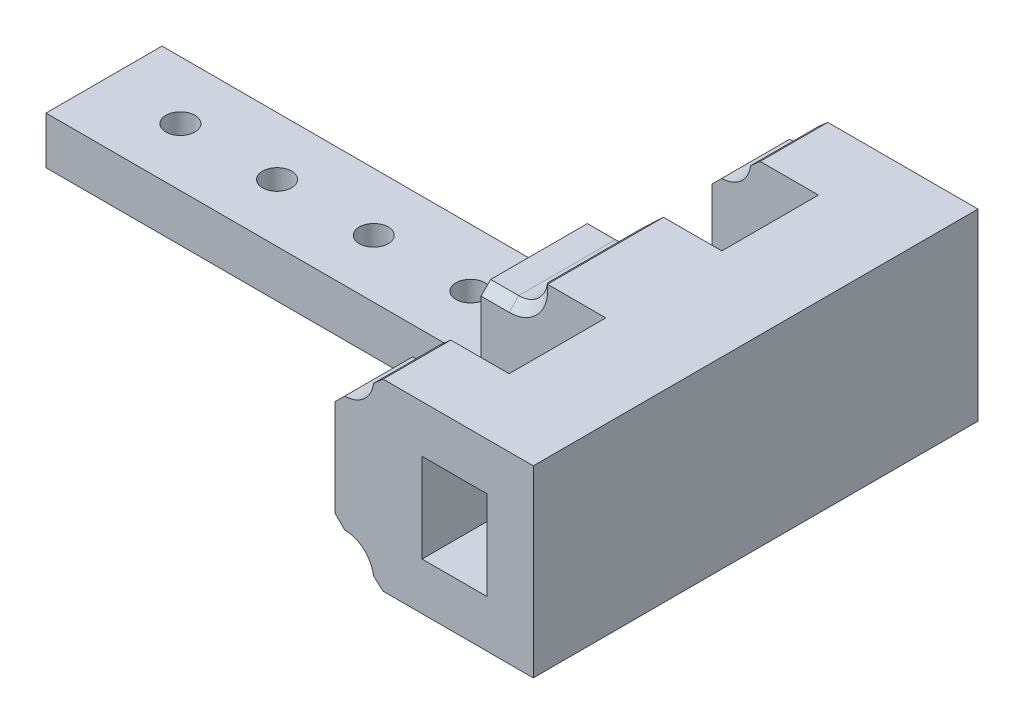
ISO-10303-21;
HEADER;
FILE_DESCRIPTION(('STEP AP214'),'2;1');
FILE_NAME('part.step','',(''),(''),'','','');
FILE_SCHEMA(('AUTOMOTIVE_DESIGN { 1 0 10303 214 1 1 1 1 }'));
ENDSEC;
DATA;
#1=APPLICATION_CONTEXT('core data for automotive mechanical design processes');
#2=APPLICATION_PROTOCOL_DEFINITION('international standard','automotive_design',2000,#1);
#3=PRODUCT_CONTEXT('',#1,'mechanical');
#4=PRODUCT('Part','Part','',(#3));
#5=PRODUCT_RELATED_PRODUCT_CATEGORY('part','',(#4));
#6=PRODUCT_DEFINITION_FORMATION('','',#4);
#7=PRODUCT_DEFINITION_CONTEXT('part definition',#1,'design');
#8=PRODUCT_DEFINITION('design','',#6,#7);
#9=PRODUCT_DEFINITION_SHAPE('','',#8);
#10=(LENGTH_UNIT() NAMED_UNIT(*) SI_UNIT(.MILLI.,.METRE.));
#11=(NAMED_UNIT(*) PLANE_ANGLE_UNIT() SI_UNIT($,.RADIAN.));
#12=(NAMED_UNIT(*) SI_UNIT($,.STERADIAN.) SOLID_ANGLE_UNIT());
#13=UNCERTAINTY_MEASURE_WITH_UNIT(LENGTH_MEASURE(1.E-05),#10,'distance_accuracy_value','');
#14=(GEOMETRIC_REPRESENTATION_CONTEXT(3) GLOBAL_UNCERTAINTY_ASSIGNED_CONTEXT((#13)) GLOBAL_UNIT_ASSIGNED_CONTEXT((#10,
#11,#12)) REPRESENTATION_CONTEXT('',''));
#15=CARTESIAN_POINT('',(0.,0.,0.));
#16=DIRECTION('',(0.,0.,1.));
#17=DIRECTION('',(1.,0.,0.));
#18=AXIS2_PLACEMENT_3D('',#15,#16,#17);
#19=CARTESIAN_POINT('',(0.,7.,0.));
#20=DIRECTION('',(0.,1.,0.));
#21=DIRECTION('',(1.,0.,0.));
#22=AXIS2_PLACEMENT_3D('',#19,#20,#21);
#23=PLANE('',#22);
#24=DIRECTION('',(0.,0.,-1.));
#25=VECTOR('',#24,1.);
#26=CARTESIAN_POINT('',(82.,7.00000000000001,23.));
#27=LINE('',#26,#25);
#28=CARTESIAN_POINT('',(82.,7.00000000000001,4.99999991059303));
#29=VERTEX_POINT('',#28);
#30=CARTESIAN_POINT('',(82.,7.00000000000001,-5.00000008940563));
#31=VERTEX_POINT('',#30);
#32=EDGE_CURVE('E657',#29,#31,#27,.T.);
#33=ORIENTED_EDGE('',*,*,#32,.T.);
#34=DIRECTION('',(-1.,0.,-9.42872354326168E-13));
#35=VECTOR('',#34,1.);
#36=CARTESIAN_POINT('',(79.0999999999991,7.,-5.00000008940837));
#37=LINE('',#36,#35);
#38=CARTESIAN_POINT('',(79.1,7.,-5.00000008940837));
#39=VERTEX_POINT('',#38);
#40=EDGE_CURVE('E1093',#31,#39,#37,.T.);
#41=ORIENTED_EDGE('',*,*,#40,.T.);
#42=DIRECTION('',(0.,0.,-1.));
#43=VECTOR('',#42,1.);
#44=CARTESIAN_POINT('',(79.1,7.,0.));
#45=LINE('',#44,#43);
#46=CARTESIAN_POINT('',(79.1,7.,4.99999991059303));
#47=VERTEX_POINT('',#46);
#48=EDGE_CURVE('E406',#47,#39,#45,.T.);
#49=ORIENTED_EDGE('',*,*,#48,.F.);
#50=DIRECTION('',(1.,0.,0.));
#51=VECTOR('',#50,1.);
#52=CARTESIAN_POINT('',(82.,7.,4.99999991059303));
#53=LINE('',#52,#51);
#54=EDGE_CURVE('E1095',#47,#29,#53,.T.);
#55=ORIENTED_EDGE('',*,*,#54,.T.);
#56=EDGE_LOOP('',(#33,#41,#49,#55));
#57=FACE_BOUND('',#56,.T.);
#58=ADVANCED_FACE('F62',(#57),#23,.T.);
#59=CARTESIAN_POINT('',(0.,-5.,0.));
#60=DIRECTION('',(0.,1.,0.));
#61=DIRECTION('',(0.,0.,1.));
#62=AXIS2_PLACEMENT_3D('',#59,#60,#61);
#63=PLANE('',#62);
#64=CARTESIAN_POINT('',(72.,-5.,1.39659253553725E-13));
#65=DIRECTION('',(0.,1.,0.));
#66=DIRECTION('',(0.,0.,1.));
#67=AXIS2_PLACEMENT_3D('',#64,#65,#66);
#68=CIRCLE('',#67,1.50000000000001);
#69=CARTESIAN_POINT('',(72.,-5.,1.50000000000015));
#70=VERTEX_POINT('',#69);
#71=EDGE_CURVE('E429',#70,#70,#68,.T.);
#72=ORIENTED_EDGE('',*,*,#71,.T.);
#73=EDGE_LOOP('',(#72));
#74=FACE_BOUND('',#73,.T.);
#75=CARTESIAN_POINT('',(62.,-5.,0.));
#76=DIRECTION('',(0.,1.,0.));
#77=DIRECTION('',(0.,0.,1.));
#78=AXIS2_PLACEMENT_3D('',#75,#76,#77);
#79=CIRCLE('',#78,1.5);
#80=CARTESIAN_POINT('',(62.,-5.,1.50000000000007));
#81=VERTEX_POINT('',#80);
#82=EDGE_CURVE('E804',#81,#81,#79,.T.);
#83=ORIENTED_EDGE('',*,*,#82,.T.);
#84=EDGE_LOOP('',(#83));
#85=FACE_BOUND('',#84,.T.);
#86=CARTESIAN_POINT('',(42.,-5.,0.));
#87=DIRECTION('',(0.,1.,0.));
#88=DIRECTION('',(0.,0.,1.));
#89=AXIS2_PLACEMENT_3D('',#86,#87,#88);
#90=CIRCLE('',#89,1.5);
#91=CARTESIAN_POINT('',(42.,-5.,1.5));
#92=VERTEX_POINT('',#91);
#93=EDGE_CURVE('E800',#92,#92,#90,.T.);
#94=ORIENTED_EDGE('',*,*,#93,.T.);
#95=EDGE_LOOP('',(#94));
#96=FACE_BOUND('',#95,.T.);
#97=CARTESIAN_POINT('',(52.,-5.,0.));
#98=DIRECTION('',(0.,1.,0.));
#99=DIRECTION('',(0.,0.,1.));
#100=AXIS2_PLACEMENT_3D('',#97,#98,#99);
#101=CIRCLE('',#100,1.5);
#102=CARTESIAN_POINT('',(52.,-5.,1.5));
#103=VERTEX_POINT('',#102);
#104=EDGE_CURVE('E412',#103,#103,#101,.T.);
#105=ORIENTED_EDGE('',*,*,#104,.T.);
#106=EDGE_LOOP('',(#105));
#107=FACE_BOUND('',#106,.T.);
#108=DIRECTION('',(-1.,0.,0.));
#109=VECTOR('',#108,1.);
#110=CARTESIAN_POINT('',(22.,-5.,5.99999991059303));
#111=LINE('',#110,#109);
#112=CARTESIAN_POINT('',(82.,-5.,6.));
#113=VERTEX_POINT('',#112);
#114=CARTESIAN_POINT('',(34.1,-5.,6.));
#115=VERTEX_POINT('',#114);
#116=EDGE_CURVE('E660',#113,#115,#111,.T.);
#117=ORIENTED_EDGE('',*,*,#116,.T.);
#118=DIRECTION('',(0.,0.,-1.));
#119=VECTOR('',#118,1.);
#120=CARTESIAN_POINT('',(34.1,-5.,0.));
#121=LINE('',#120,#119);
#122=CARTESIAN_POINT('',(34.1,-5.,-6.00000008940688));
#123=VERTEX_POINT('',#122);
#124=EDGE_CURVE('E392',#115,#123,#121,.T.);
#125=ORIENTED_EDGE('',*,*,#124,.T.);
#126=DIRECTION('',(1.,0.,0.));
#127=VECTOR('',#126,1.);
#128=CARTESIAN_POINT('',(34.,-5.,-6.00000008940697));
#129=LINE('',#128,#127);
#130=CARTESIAN_POINT('',(82.,-5.,-6.));
#131=VERTEX_POINT('',#130);
#132=EDGE_CURVE('E656',#123,#131,#129,.T.);
#133=ORIENTED_EDGE('',*,*,#132,.T.);
#134=DIRECTION('',(0.,0.,-1.));
#135=VECTOR('',#134,1.);
#136=CARTESIAN_POINT('',(82.,-5.,23.));
#137=LINE('',#136,#135);
#138=EDGE_CURVE('E651',#113,#131,#137,.T.);
#139=ORIENTED_EDGE('',*,*,#138,.F.);
#140=EDGE_LOOP('',(#117,#125,#133,#139));
#141=FACE_BOUND('',#140,.T.);
#142=ADVANCED_FACE('F868',(#74,#85,#96,#107,#141),#63,.F.);
#143=CARTESIAN_POINT('',(82.,10.,23.));
#144=DIRECTION('',(0.,0.,-1.));
#145=DIRECTION('',(-1.,0.,0.));
#146=AXIS2_PLACEMENT_3D('',#143,#144,#145);
#147=CYLINDRICAL_SURFACE('',#146,3.);
#148=DIRECTION('',(0.,0.,-1.));
#149=VECTOR('',#148,1.);
#150=CARTESIAN_POINT('',(84.9764702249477,9.62499999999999,23.));
#151=LINE('',#150,#149);
#152=CARTESIAN_POINT('',(84.9764702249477,9.62499999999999,4.99999991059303));
#153=VERTEX_POINT('',#152);
#154=CARTESIAN_POINT('',(84.9764702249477,9.62499999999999,-5.00000008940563));
#155=VERTEX_POINT('',#154);
#156=EDGE_CURVE('E793',#153,#155,#151,.T.);
#157=ORIENTED_EDGE('',*,*,#156,.T.);
#158=CARTESIAN_POINT('',(82.,10.,-5.00000008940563));
#159=DIRECTION('',(0.,0.,1.));
#160=DIRECTION('',(1.,0.,0.));
#161=AXIS2_PLACEMENT_3D('',#158,#159,#160);
#162=CIRCLE('',#161,3.);
#163=EDGE_CURVE('E1104',#155,#31,#162,.F.);
#164=ORIENTED_EDGE('',*,*,#163,.T.);
#165=ORIENTED_EDGE('',*,*,#32,.F.);
#166=CARTESIAN_POINT('',(82.,10.,4.99999991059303));
#167=DIRECTION('',(0.,0.,-1.));
#168=DIRECTION('',(-1.,0.,0.));
#169=AXIS2_PLACEMENT_3D('',#166,#167,#168);
#170=CIRCLE('',#169,3.);
#171=EDGE_CURVE('E1119',#29,#153,#170,.F.);
#172=ORIENTED_EDGE('',*,*,#171,.T.);
#173=EDGE_LOOP('',(#157,#164,#165,#172));
#174=FACE_BOUND('',#173,.T.);
#175=ADVANCED_FACE('F876',(#174),#147,.F.);
#176=CARTESIAN_POINT('',(82.,10.,-16.));
#177=DIRECTION('',(0.,0.,1.));
#178=DIRECTION('',(0.,-1.,0.));
#179=AXIS2_PLACEMENT_3D('',#176,#177,#178);
#180=CIRCLE('',#179,3.);
#181=CARTESIAN_POINT('',(84.9764702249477,9.62499999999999,-16.));
#182=VERTEX_POINT('',#181);
#183=CARTESIAN_POINT('',(82.,7.,-16.));
#184=VERTEX_POINT('',#183);
#185=EDGE_CURVE('E488',#182,#184,#180,.F.);
#186=ORIENTED_EDGE('',*,*,#185,.F.);
#187=DIRECTION('',(0.,0.,-1.));
#188=VECTOR('',#187,1.);
#189=CARTESIAN_POINT('',(84.9764702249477,9.62499999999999,23.));
#190=LINE('',#189,#188);
#191=CARTESIAN_POINT('',(84.9764702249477,9.62499999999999,-23.));
#192=VERTEX_POINT('',#191);
#193=EDGE_CURVE('E775',#182,#192,#190,.T.);
#194=ORIENTED_EDGE('',*,*,#193,.T.);
#195=CARTESIAN_POINT('',(82.,10.,-23.));
#196=DIRECTION('',(0.,0.,-1.));
#197=DIRECTION('',(1.,0.,0.));
#198=AXIS2_PLACEMENT_3D('',#195,#196,#197);
#199=CIRCLE('',#198,3.);
#200=CARTESIAN_POINT('',(82.,7.00000000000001,-23.));
#201=VERTEX_POINT('',#200);
#202=EDGE_CURVE('E600',#192,#201,#199,.T.);
#203=ORIENTED_EDGE('',*,*,#202,.T.);
#204=EDGE_CURVE('E650',#184,#201,#27,.T.);
#205=ORIENTED_EDGE('',*,*,#204,.F.);
#206=EDGE_LOOP('',(#186,#194,#203,#205));
#207=FACE_BOUND('',#206,.T.);
#208=ADVANCED_FACE('F1125',(#207),#147,.F.);
#209=CARTESIAN_POINT('',(82.,10.,23.));
#210=DIRECTION('',(0.,0.,-1.));
#211=DIRECTION('',(1.,0.,0.));
#212=AXIS2_PLACEMENT_3D('',#209,#210,#211);
#213=CIRCLE('',#212,3.);
#214=CARTESIAN_POINT('',(84.9764702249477,9.62499999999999,23.));
#215=VERTEX_POINT('',#214);
#216=CARTESIAN_POINT('',(82.,7.00000000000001,23.));
#217=VERTEX_POINT('',#216);
#218=EDGE_CURVE('E602',#215,#217,#213,.T.);
#219=ORIENTED_EDGE('',*,*,#218,.F.);
#220=DIRECTION('',(0.,0.,-1.));
#221=VECTOR('',#220,1.);
#222=CARTESIAN_POINT('',(84.9764702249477,9.62499999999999,23.));
#223=LINE('',#222,#221);
#224=CARTESIAN_POINT('',(84.9764702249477,9.62499999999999,16.));
#225=VERTEX_POINT('',#224);
#226=EDGE_CURVE('E789',#215,#225,#223,.T.);
#227=ORIENTED_EDGE('',*,*,#226,.T.);
#228=CARTESIAN_POINT('',(82.,10.,16.));
#229=DIRECTION('',(0.,0.,-1.));
#230=DIRECTION('',(-1.,0.,0.));
#231=AXIS2_PLACEMENT_3D('',#228,#229,#230);
#232=CIRCLE('',#231,3.);
#233=CARTESIAN_POINT('',(82.,7.,16.));
#234=VERTEX_POINT('',#233);
#235=EDGE_CURVE('E461',#234,#225,#232,.F.);
#236=ORIENTED_EDGE('',*,*,#235,.F.);
#237=EDGE_CURVE('E652',#217,#234,#27,.T.);
#238=ORIENTED_EDGE('',*,*,#237,.F.);
#239=EDGE_LOOP('',(#219,#227,#236,#238));
#240=FACE_BOUND('',#239,.T.);
#241=ADVANCED_FACE('F962',(#240),#147,.F.);
#242=CARTESIAN_POINT('',(82.,-8.,23.));
#243=DIRECTION('',(0.,0.,-1.));
#244=DIRECTION('',(-1.,0.,0.));
#245=AXIS2_PLACEMENT_3D('',#242,#243,#244);
#246=CYLINDRICAL_SURFACE('',#245,3.);
#247=CARTESIAN_POINT('',(82.,-8.,-6.));
#248=DIRECTION('',(0.,0.,-1.));
#249=DIRECTION('',(-1.,0.,0.));
#250=AXIS2_PLACEMENT_3D('',#247,#248,#249);
#251=CIRCLE('',#250,3.);
#252=CARTESIAN_POINT('',(84.9764702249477,-7.62499999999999,-6.));
#253=VERTEX_POINT('',#252);
#254=EDGE_CURVE('E530',#253,#131,#251,.F.);
#255=ORIENTED_EDGE('',*,*,#254,.F.);
#256=DIRECTION('',(0.,0.,-1.));
#257=VECTOR('',#256,1.);
#258=CARTESIAN_POINT('',(84.9764702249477,-7.62499999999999,23.));
#259=LINE('',#258,#257);
#260=CARTESIAN_POINT('',(84.9764702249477,-7.62499999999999,6.));
#261=VERTEX_POINT('',#260);
#262=EDGE_CURVE('E736',#253,#261,#259,.F.);
#263=ORIENTED_EDGE('',*,*,#262,.T.);
#264=CARTESIAN_POINT('',(82.,-8.,6.));
#265=DIRECTION('',(0.,0.,1.));
#266=DIRECTION('',(1.,0.,0.));
#267=AXIS2_PLACEMENT_3D('',#264,#265,#266);
#268=CIRCLE('',#267,3.);
#269=EDGE_CURVE('E434',#113,#261,#268,.F.);
#270=ORIENTED_EDGE('',*,*,#269,.F.);
#271=ORIENTED_EDGE('',*,*,#138,.T.);
#272=EDGE_LOOP('',(#255,#263,#270,#271));
#273=FACE_BOUND('',#272,.T.);
#274=ADVANCED_FACE('F1060',(#273),#246,.F.);
#275=CARTESIAN_POINT('',(82.,-8.,-23.));
#276=DIRECTION('',(0.,0.,-1.));
#277=DIRECTION('',(1.,0.,0.));
#278=AXIS2_PLACEMENT_3D('',#275,#276,#277);
#279=CIRCLE('',#278,3.);
#280=CARTESIAN_POINT('',(82.,-5.,-23.));
#281=VERTEX_POINT('',#280);
#282=CARTESIAN_POINT('',(84.9764702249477,-7.62499999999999,-23.));
#283=VERTEX_POINT('',#282);
#284=EDGE_CURVE('E625',#281,#283,#279,.T.);
#285=ORIENTED_EDGE('',*,*,#284,.T.);
#286=DIRECTION('',(0.,0.,-1.));
#287=VECTOR('',#286,1.);
#288=CARTESIAN_POINT('',(84.9764702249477,-7.62499999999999,23.));
#289=LINE('',#288,#287);
#290=CARTESIAN_POINT('',(84.9764702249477,-7.62499999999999,-16.));
#291=VERTEX_POINT('',#290);
#292=EDGE_CURVE('E754',#283,#291,#289,.F.);
#293=ORIENTED_EDGE('',*,*,#292,.T.);
#294=CARTESIAN_POINT('',(82.,-8.,-16.));
#295=DIRECTION('',(0.,0.,1.));
#296=DIRECTION('',(0.,-1.,0.));
#297=AXIS2_PLACEMENT_3D('',#294,#295,#296);
#298=CIRCLE('',#297,3.);
#299=CARTESIAN_POINT('',(82.,-5.,-16.));
#300=VERTEX_POINT('',#299);
#301=EDGE_CURVE('E484',#300,#291,#298,.F.);
#302=ORIENTED_EDGE('',*,*,#301,.F.);
#303=EDGE_CURVE('E645',#300,#281,#137,.T.);
#304=ORIENTED_EDGE('',*,*,#303,.T.);
#305=EDGE_LOOP('',(#285,#293,#302,#304));
#306=FACE_BOUND('',#305,.T.);
#307=ADVANCED_FACE('F1071',(#306),#246,.F.);
#308=CARTESIAN_POINT('',(82.,-8.,16.));
#309=DIRECTION('',(0.,0.,-1.));
#310=DIRECTION('',(-1.,0.,0.));
#311=AXIS2_PLACEMENT_3D('',#308,#309,#310);
#312=CIRCLE('',#311,3.);
#313=CARTESIAN_POINT('',(84.9764702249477,-7.62499999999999,16.));
#314=VERTEX_POINT('',#313);
#315=CARTESIAN_POINT('',(82.,-5.,16.));
#316=VERTEX_POINT('',#315);
#317=EDGE_CURVE('E457',#314,#316,#312,.F.);
#318=ORIENTED_EDGE('',*,*,#317,.F.);
#319=DIRECTION('',(0.,0.,-1.));
#320=VECTOR('',#319,1.);
#321=CARTESIAN_POINT('',(84.9764702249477,-7.62499999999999,23.));
#322=LINE('',#321,#320);
#323=CARTESIAN_POINT('',(84.9764702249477,-7.62499999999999,23.));
#324=VERTEX_POINT('',#323);
#325=EDGE_CURVE('E730',#314,#324,#322,.F.);
#326=ORIENTED_EDGE('',*,*,#325,.T.);
#327=CARTESIAN_POINT('',(82.,-8.,23.));
#328=DIRECTION('',(0.,0.,-1.));
#329=DIRECTION('',(1.,0.,0.));
#330=AXIS2_PLACEMENT_3D('',#327,#328,#329);
#331=CIRCLE('',#330,3.);
#332=CARTESIAN_POINT('',(82.,-5.,23.));
#333=VERTEX_POINT('',#332);
#334=EDGE_CURVE('E606',#333,#324,#331,.T.);
#335=ORIENTED_EDGE('',*,*,#334,.F.);
#336=EDGE_CURVE('E646',#333,#316,#137,.T.);
#337=ORIENTED_EDGE('',*,*,#336,.T.);
#338=EDGE_LOOP('',(#318,#326,#335,#337));
#339=FACE_BOUND('',#338,.T.);
#340=ADVANCED_FACE('F977',(#339),#246,.F.);
#341=CARTESIAN_POINT('',(85.,-8.49999999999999,23.));
#342=DIRECTION('',(0.,1.,0.));
#343=DIRECTION('',(0.,0.,1.));
#344=AXIS2_PLACEMENT_3D('',#341,#342,#343);
#345=PLANE('',#344);
#346=DIRECTION('',(1.,0.,0.));
#347=VECTOR('',#346,1.);
#348=CARTESIAN_POINT('',(85.,-8.49999999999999,23.));
#349=LINE('',#348,#347);
#350=CARTESIAN_POINT('',(85.9686269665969,-8.49999999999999,23.));
#351=VERTEX_POINT('',#350);
#352=CARTESIAN_POINT('',(101.5,-8.49999999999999,23.));
#353=VERTEX_POINT('',#352);
#354=EDGE_CURVE('E611',#351,#353,#349,.T.);
#355=ORIENTED_EDGE('',*,*,#354,.F.);
#356=DIRECTION('',(0.,0.,-1.));
#357=VECTOR('',#356,1.);
#358=CARTESIAN_POINT('',(85.9686269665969,-8.49999999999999,23.));
#359=LINE('',#358,#357);
#360=CARTESIAN_POINT('',(85.9686269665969,-8.49999999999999,16.));
#361=VERTEX_POINT('',#360);
#362=EDGE_CURVE('E726',#351,#361,#359,.T.);
#363=ORIENTED_EDGE('',*,*,#362,.T.);
#364=DIRECTION('',(-1.,0.,0.));
#365=VECTOR('',#364,1.);
#366=CARTESIAN_POINT('',(85.,-8.49999999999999,16.));
#367=LINE('',#366,#365);
#368=CARTESIAN_POINT('',(92.,-8.49999999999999,16.));
#369=VERTEX_POINT('',#368);
#370=EDGE_CURVE('E468',#369,#361,#367,.T.);
#371=ORIENTED_EDGE('',*,*,#370,.F.);
#372=DIRECTION('',(0.,0.,1.));
#373=VECTOR('',#372,1.);
#374=CARTESIAN_POINT('',(92.,-8.49999999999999,23.));
#375=LINE('',#374,#373);
#376=CARTESIAN_POINT('',(92.,-8.49999999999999,6.));
#377=VERTEX_POINT('',#376);
#378=EDGE_CURVE('E541',#377,#369,#375,.T.);
#379=ORIENTED_EDGE('',*,*,#378,.F.);
#380=DIRECTION('',(1.,0.,0.));
#381=VECTOR('',#380,1.);
#382=CARTESIAN_POINT('',(85.,-8.49999999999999,6.));
#383=LINE('',#382,#381);
#384=CARTESIAN_POINT('',(85.9686269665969,-8.49999999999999,6.));
#385=VERTEX_POINT('',#384);
#386=EDGE_CURVE('E442',#385,#377,#383,.T.);
#387=ORIENTED_EDGE('',*,*,#386,.F.);
#388=DIRECTION('',(0.,0.,-1.));
#389=VECTOR('',#388,1.);
#390=CARTESIAN_POINT('',(85.9686269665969,-8.49999999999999,23.));
#391=LINE('',#390,#389);
#392=CARTESIAN_POINT('',(85.9686269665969,-8.49999999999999,-6.));
#393=VERTEX_POINT('',#392);
#394=EDGE_CURVE('E722',#385,#393,#391,.T.);
#395=ORIENTED_EDGE('',*,*,#394,.T.);
#396=DIRECTION('',(-1.,0.,0.));
#397=VECTOR('',#396,1.);
#398=CARTESIAN_POINT('',(85.,-8.49999999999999,-6.));
#399=LINE('',#398,#397);
#400=CARTESIAN_POINT('',(92.,-8.49999999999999,-6.));
#401=VERTEX_POINT('',#400);
#402=EDGE_CURVE('E526',#401,#393,#399,.T.);
#403=ORIENTED_EDGE('',*,*,#402,.F.);
#404=DIRECTION('',(0.,0.,1.));
#405=VECTOR('',#404,1.);
#406=CARTESIAN_POINT('',(92.,-8.49999999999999,23.));
#407=LINE('',#406,#405);
#408=CARTESIAN_POINT('',(92.,-8.49999999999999,-16.));
#409=VERTEX_POINT('',#408);
#410=EDGE_CURVE('E551',#409,#401,#407,.T.);
#411=ORIENTED_EDGE('',*,*,#410,.F.);
#412=DIRECTION('',(1.,0.,0.));
#413=VECTOR('',#412,1.);
#414=CARTESIAN_POINT('',(85.,-8.49999999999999,-16.));
#415=LINE('',#414,#413);
#416=CARTESIAN_POINT('',(85.9686269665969,-8.49999999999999,-16.));
#417=VERTEX_POINT('',#416);
#418=EDGE_CURVE('E496',#417,#409,#415,.T.);
#419=ORIENTED_EDGE('',*,*,#418,.F.);
#420=DIRECTION('',(0.,0.,-1.));
#421=VECTOR('',#420,1.);
#422=CARTESIAN_POINT('',(85.9686269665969,-8.49999999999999,23.));
#423=LINE('',#422,#421);
#424=CARTESIAN_POINT('',(85.9686269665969,-8.49999999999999,-23.));
#425=VERTEX_POINT('',#424);
#426=EDGE_CURVE('E718',#417,#425,#423,.T.);
#427=ORIENTED_EDGE('',*,*,#426,.T.);
#428=DIRECTION('',(1.,0.,0.));
#429=VECTOR('',#428,1.);
#430=CARTESIAN_POINT('',(85.,-8.49999999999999,-23.));
#431=LINE('',#430,#429);
#432=CARTESIAN_POINT('',(101.5,-8.49999999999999,-23.));
#433=VERTEX_POINT('',#432);
#434=EDGE_CURVE('E629',#425,#433,#431,.T.);
#435=ORIENTED_EDGE('',*,*,#434,.T.);
#436=DIRECTION('',(0.,0.,-1.));
#437=VECTOR('',#436,1.);
#438=CARTESIAN_POINT('',(101.5,-8.49999999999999,23.));
#439=LINE('',#438,#437);
#440=EDGE_CURVE('E641',#353,#433,#439,.T.);
#441=ORIENTED_EDGE('',*,*,#440,.F.);
#442=EDGE_LOOP('',(#355,#363,#371,#379,#387,#395,#403,#411,#419,#427,#435,#441));
#443=FACE_BOUND('',#442,.T.);
#444=ADVANCED_FACE('F983',(#443),#345,.F.);
#445=CARTESIAN_POINT('',(85.,10.5,23.));
#446=DIRECTION('',(0.,-1.,0.));
#447=DIRECTION('',(0.,0.,-1.));
#448=AXIS2_PLACEMENT_3D('',#445,#446,#447);
#449=PLANE('',#448);
#450=DIRECTION('',(-1.,0.,0.));
#451=VECTOR('',#450,1.);
#452=CARTESIAN_POINT('',(85.,10.5,-23.));
#453=LINE('',#452,#451);
#454=CARTESIAN_POINT('',(101.5,10.5,-23.));
#455=VERTEX_POINT('',#454);
#456=CARTESIAN_POINT('',(85.9686269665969,10.5,-23.));
#457=VERTEX_POINT('',#456);
#458=EDGE_CURVE('E607',#455,#457,#453,.T.);
#459=ORIENTED_EDGE('',*,*,#458,.T.);
#460=DIRECTION('',(0.,0.,1.));
#461=VECTOR('',#460,1.);
#462=CARTESIAN_POINT('',(85.9686269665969,10.5,23.));
#463=LINE('',#462,#461);
#464=CARTESIAN_POINT('',(85.9686269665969,10.5,-16.));
#465=VERTEX_POINT('',#464);
#466=EDGE_CURVE('E786',#457,#465,#463,.T.);
#467=ORIENTED_EDGE('',*,*,#466,.T.);
#468=DIRECTION('',(-1.,0.,0.));
#469=VECTOR('',#468,1.);
#470=CARTESIAN_POINT('',(85.,10.5,-16.));
#471=LINE('',#470,#469);
#472=CARTESIAN_POINT('',(92.,10.5,-16.));
#473=VERTEX_POINT('',#472);
#474=EDGE_CURVE('E492',#473,#465,#471,.T.);
#475=ORIENTED_EDGE('',*,*,#474,.F.);
#476=DIRECTION('',(0.,0.,-1.));
#477=VECTOR('',#476,1.);
#478=CARTESIAN_POINT('',(92.,10.5,23.));
#479=LINE('',#478,#477);
#480=CARTESIAN_POINT('',(92.,10.5,-6.));
#481=VERTEX_POINT('',#480);
#482=EDGE_CURVE('E548',#481,#473,#479,.T.);
#483=ORIENTED_EDGE('',*,*,#482,.F.);
#484=DIRECTION('',(1.,0.,0.));
#485=VECTOR('',#484,1.);
#486=CARTESIAN_POINT('',(85.,10.5,-6.));
#487=LINE('',#486,#485);
#488=CARTESIAN_POINT('',(85.9686269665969,10.5,-6.));
#489=VERTEX_POINT('',#488);
#490=EDGE_CURVE('E523',#489,#481,#487,.T.);
#491=ORIENTED_EDGE('',*,*,#490,.F.);
#492=DIRECTION('',(0.,0.,1.));
#493=VECTOR('',#492,1.);
#494=CARTESIAN_POINT('',(85.9686269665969,10.5,23.));
#495=LINE('',#494,#493);
#496=CARTESIAN_POINT('',(85.9686269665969,10.5,6.));
#497=VERTEX_POINT('',#496);
#498=EDGE_CURVE('E779',#489,#497,#495,.T.);
#499=ORIENTED_EDGE('',*,*,#498,.T.);
#500=DIRECTION('',(-1.,0.,0.));
#501=VECTOR('',#500,1.);
#502=CARTESIAN_POINT('',(85.,10.5,6.));
#503=LINE('',#502,#501);
#504=CARTESIAN_POINT('',(92.,10.5,6.));
#505=VERTEX_POINT('',#504);
#506=EDGE_CURVE('E438',#505,#497,#503,.T.);
#507=ORIENTED_EDGE('',*,*,#506,.F.);
#508=DIRECTION('',(0.,0.,-1.));
#509=VECTOR('',#508,1.);
#510=CARTESIAN_POINT('',(92.,10.5,23.));
#511=LINE('',#510,#509);
#512=CARTESIAN_POINT('',(92.,10.5,16.));
#513=VERTEX_POINT('',#512);
#514=EDGE_CURVE('E538',#513,#505,#511,.T.);
#515=ORIENTED_EDGE('',*,*,#514,.F.);
#516=DIRECTION('',(1.,0.,0.));
#517=VECTOR('',#516,1.);
#518=CARTESIAN_POINT('',(85.,10.5,16.));
#519=LINE('',#518,#517);
#520=CARTESIAN_POINT('',(85.9686269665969,10.5,16.));
#521=VERTEX_POINT('',#520);
#522=EDGE_CURVE('E465',#521,#513,#519,.T.);
#523=ORIENTED_EDGE('',*,*,#522,.F.);
#524=DIRECTION('',(0.,0.,1.));
#525=VECTOR('',#524,1.);
#526=CARTESIAN_POINT('',(85.9686269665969,10.5,23.));
#527=LINE('',#526,#525);
#528=CARTESIAN_POINT('',(85.9686269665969,10.5,23.));
#529=VERTEX_POINT('',#528);
#530=EDGE_CURVE('E783',#521,#529,#527,.T.);
#531=ORIENTED_EDGE('',*,*,#530,.T.);
#532=DIRECTION('',(-1.,0.,0.));
#533=VECTOR('',#532,1.);
#534=CARTESIAN_POINT('',(85.,10.5,23.));
#535=LINE('',#534,#533);
#536=CARTESIAN_POINT('',(101.5,10.5,23.));
#537=VERTEX_POINT('',#536);
#538=EDGE_CURVE('E617',#537,#529,#535,.T.);
#539=ORIENTED_EDGE('',*,*,#538,.F.);
#540=DIRECTION('',(0.,0.,-1.));
#541=VECTOR('',#540,1.);
#542=CARTESIAN_POINT('',(101.5,10.5,23.));
#543=LINE('',#542,#541);
#544=EDGE_CURVE('E621',#537,#455,#543,.T.);
#545=ORIENTED_EDGE('',*,*,#544,.T.);
#546=EDGE_LOOP('',(#459,#467,#475,#483,#491,#499,#507,#515,#523,#531,#539,#545));
#547=FACE_BOUND('',#546,.T.);
#548=ADVANCED_FACE('F993',(#547),#449,.F.);
#549=CARTESIAN_POINT('',(90.,-3.6,23.));
#550=DIRECTION('',(1.,0.,0.));
#551=DIRECTION('',(0.,0.,-1.));
#552=AXIS2_PLACEMENT_3D('',#549,#550,#551);
#553=PLANE('',#552);
#554=DIRECTION('',(0.,0.,-1.));
#555=VECTOR('',#554,1.);
#556=CARTESIAN_POINT('',(90.,-3.6,23.));
#557=LINE('',#556,#555);
#558=CARTESIAN_POINT('',(90.,-3.6,6.));
#559=VERTEX_POINT('',#558);
#560=CARTESIAN_POINT('',(90.,-3.6,-6.));
#561=VERTEX_POINT('',#560);
#562=EDGE_CURVE('E601',#559,#561,#557,.T.);
#563=ORIENTED_EDGE('',*,*,#562,.T.);
#564=DIRECTION('',(0.,1.,0.));
#565=VECTOR('',#564,1.);
#566=CARTESIAN_POINT('',(90.,-3.6,-6.));
#567=LINE('',#566,#565);
#568=CARTESIAN_POINT('',(90.,5.6,-6.));
#569=VERTEX_POINT('',#568);
#570=EDGE_CURVE('E515',#561,#569,#567,.T.);
#571=ORIENTED_EDGE('',*,*,#570,.T.);
#572=DIRECTION('',(0.,0.,-1.));
#573=VECTOR('',#572,1.);
#574=CARTESIAN_POINT('',(90.,5.6,23.));
#575=LINE('',#574,#573);
#576=CARTESIAN_POINT('',(90.,5.6,6.));
#577=VERTEX_POINT('',#576);
#578=EDGE_CURVE('E589',#577,#569,#575,.T.);
#579=ORIENTED_EDGE('',*,*,#578,.F.);
#580=DIRECTION('',(0.,-1.,0.));
#581=VECTOR('',#580,1.);
#582=CARTESIAN_POINT('',(90.,-3.6,6.));
#583=LINE('',#582,#581);
#584=EDGE_CURVE('E449',#577,#559,#583,.T.);
#585=ORIENTED_EDGE('',*,*,#584,.T.);
#586=EDGE_LOOP('',(#563,#571,#579,#585));
#587=FACE_BOUND('',#586,.T.);
#588=ADVANCED_FACE('F1038',(#587),#553,.T.);
#589=CARTESIAN_POINT('',(90.,5.6,-16.));
#590=VERTEX_POINT('',#589);
#591=CARTESIAN_POINT('',(90.,5.6,-23.));
#592=VERTEX_POINT('',#591);
#593=EDGE_CURVE('E569',#590,#592,#575,.T.);
#594=ORIENTED_EDGE('',*,*,#593,.F.);
#595=DIRECTION('',(0.,-1.,0.));
#596=VECTOR('',#595,1.);
#597=CARTESIAN_POINT('',(90.,-3.6,-16.));
#598=LINE('',#597,#596);
#599=CARTESIAN_POINT('',(90.,-3.6,-16.));
#600=VERTEX_POINT('',#599);
#601=EDGE_CURVE('E503',#590,#600,#598,.T.);
#602=ORIENTED_EDGE('',*,*,#601,.T.);
#603=CARTESIAN_POINT('',(90.,-3.6,-23.));
#604=VERTEX_POINT('',#603);
#605=EDGE_CURVE('E595',#600,#604,#557,.T.);
#606=ORIENTED_EDGE('',*,*,#605,.T.);
#607=DIRECTION('',(0.,-1.,0.));
#608=VECTOR('',#607,1.);
#609=CARTESIAN_POINT('',(90.,-3.6,-23.));
#610=LINE('',#609,#608);
#611=EDGE_CURVE('E554',#592,#604,#610,.T.);
#612=ORIENTED_EDGE('',*,*,#611,.F.);
#613=EDGE_LOOP('',(#594,#602,#606,#612));
#614=FACE_BOUND('',#613,.T.);
#615=ADVANCED_FACE('F1023',(#614),#553,.T.);
#616=CARTESIAN_POINT('',(90.,-3.6,23.));
#617=VERTEX_POINT('',#616);
#618=CARTESIAN_POINT('',(90.,-3.6,16.));
#619=VERTEX_POINT('',#618);
#620=EDGE_CURVE('E596',#617,#619,#557,.T.);
#621=ORIENTED_EDGE('',*,*,#620,.T.);
#622=DIRECTION('',(0.,1.,0.));
#623=VECTOR('',#622,1.);
#624=CARTESIAN_POINT('',(90.,-3.6,16.));
#625=LINE('',#624,#623);
#626=CARTESIAN_POINT('',(90.,5.6,16.));
#627=VERTEX_POINT('',#626);
#628=EDGE_CURVE('E476',#619,#627,#625,.T.);
#629=ORIENTED_EDGE('',*,*,#628,.T.);
#630=CARTESIAN_POINT('',(90.,5.6,23.));
#631=VERTEX_POINT('',#630);
#632=EDGE_CURVE('E584',#631,#627,#575,.T.);
#633=ORIENTED_EDGE('',*,*,#632,.F.);
#634=DIRECTION('',(0.,-1.,0.));
#635=VECTOR('',#634,1.);
#636=CARTESIAN_POINT('',(90.,-3.6,23.));
#637=LINE('',#636,#635);
#638=EDGE_CURVE('E555',#631,#617,#637,.T.);
#639=ORIENTED_EDGE('',*,*,#638,.T.);
#640=EDGE_LOOP('',(#621,#629,#633,#639));
#641=FACE_BOUND('',#640,.T.);
#642=ADVANCED_FACE('F1158',(#641),#553,.T.);
#643=CARTESIAN_POINT('',(96.7,-3.6,23.));
#644=DIRECTION('',(0.,1.,0.));
#645=DIRECTION('',(-1.,0.,0.));
#646=AXIS2_PLACEMENT_3D('',#643,#644,#645);
#647=PLANE('',#646);
#648=DIRECTION('',(0.,0.,1.));
#649=VECTOR('',#648,1.);
#650=CARTESIAN_POINT('',(92.,-3.6,23.));
#651=LINE('',#650,#649);
#652=CARTESIAN_POINT('',(92.,-3.6,-16.));
#653=VERTEX_POINT('',#652);
#654=CARTESIAN_POINT('',(92.,-3.6,-6.));
#655=VERTEX_POINT('',#654);
#656=EDGE_CURVE('E544',#653,#655,#651,.T.);
#657=ORIENTED_EDGE('',*,*,#656,.T.);
#658=DIRECTION('',(-1.,0.,0.));
#659=VECTOR('',#658,1.);
#660=CARTESIAN_POINT('',(96.7,-3.6,-6.));
#661=LINE('',#660,#659);
#662=EDGE_CURVE('E519',#655,#561,#661,.T.);
#663=ORIENTED_EDGE('',*,*,#662,.T.);
#664=ORIENTED_EDGE('',*,*,#562,.F.);
#665=DIRECTION('',(1.,0.,0.));
#666=VECTOR('',#665,1.);
#667=CARTESIAN_POINT('',(96.7,-3.6,6.));
#668=LINE('',#667,#666);
#669=CARTESIAN_POINT('',(92.,-3.6,6.));
#670=VERTEX_POINT('',#669);
#671=EDGE_CURVE('E453',#559,#670,#668,.T.);
#672=ORIENTED_EDGE('',*,*,#671,.T.);
#673=DIRECTION('',(0.,0.,1.));
#674=VECTOR('',#673,1.);
#675=CARTESIAN_POINT('',(92.,-3.6,23.));
#676=LINE('',#675,#674);
#677=CARTESIAN_POINT('',(92.,-3.6,16.));
#678=VERTEX_POINT('',#677);
#679=EDGE_CURVE('E534',#670,#678,#676,.T.);
#680=ORIENTED_EDGE('',*,*,#679,.T.);
#681=DIRECTION('',(-1.,0.,0.));
#682=VECTOR('',#681,1.);
#683=CARTESIAN_POINT('',(96.7,-3.6,16.));
#684=LINE('',#683,#682);
#685=EDGE_CURVE('E480',#678,#619,#684,.T.);
#686=ORIENTED_EDGE('',*,*,#685,.T.);
#687=ORIENTED_EDGE('',*,*,#620,.F.);
#688=DIRECTION('',(1.,0.,0.));
#689=VECTOR('',#688,1.);
#690=CARTESIAN_POINT('',(96.7,-3.6,23.));
#691=LINE('',#690,#689);
#692=CARTESIAN_POINT('',(96.7,-3.6,23.));
#693=VERTEX_POINT('',#692);
#694=EDGE_CURVE('E558',#617,#693,#691,.T.);
#695=ORIENTED_EDGE('',*,*,#694,.T.);
#696=DIRECTION('',(0.,0.,-1.));
#697=VECTOR('',#696,1.);
#698=CARTESIAN_POINT('',(96.7,-3.6,23.));
#699=LINE('',#698,#697);
#700=CARTESIAN_POINT('',(96.7,-3.6,-23.));
#701=VERTEX_POINT('',#700);
#702=EDGE_CURVE('E592',#693,#701,#699,.T.);
#703=ORIENTED_EDGE('',*,*,#702,.T.);
#704=DIRECTION('',(1.,0.,0.));
#705=VECTOR('',#704,1.);
#706=CARTESIAN_POINT('',(96.7,-3.6,-23.));
#707=LINE('',#706,#705);
#708=EDGE_CURVE('E573',#604,#701,#707,.T.);
#709=ORIENTED_EDGE('',*,*,#708,.F.);
#710=ORIENTED_EDGE('',*,*,#605,.F.);
#711=DIRECTION('',(1.,0.,0.));
#712=VECTOR('',#711,1.);
#713=CARTESIAN_POINT('',(96.7,-3.6,-16.));
#714=LINE('',#713,#712);
#715=EDGE_CURVE('E507',#600,#653,#714,.T.);
#716=ORIENTED_EDGE('',*,*,#715,.T.);
#717=EDGE_LOOP('',(#657,#663,#664,#672,#680,#686,#687,#695,#703,#709,#710,#716));
#718=FACE_BOUND('',#717,.T.);
#719=ADVANCED_FACE('F1013',(#718),#647,.T.);
#720=CARTESIAN_POINT('',(90.,5.6,23.));
#721=DIRECTION('',(0.,-1.,0.));
#722=DIRECTION('',(1.,0.,0.));
#723=AXIS2_PLACEMENT_3D('',#720,#721,#722);
#724=PLANE('',#723);
#725=ORIENTED_EDGE('',*,*,#578,.T.);
#726=DIRECTION('',(1.,0.,0.));
#727=VECTOR('',#726,1.);
#728=CARTESIAN_POINT('',(90.,5.6,-6.));
#729=LINE('',#728,#727);
#730=CARTESIAN_POINT('',(92.,5.6,-6.));
#731=VERTEX_POINT('',#730);
#732=EDGE_CURVE('E511',#569,#731,#729,.T.);
#733=ORIENTED_EDGE('',*,*,#732,.T.);
#734=DIRECTION('',(0.,0.,-1.));
#735=VECTOR('',#734,1.);
#736=CARTESIAN_POINT('',(92.,5.6,23.));
#737=LINE('',#736,#735);
#738=CARTESIAN_POINT('',(92.,5.6,-16.));
#739=VERTEX_POINT('',#738);
#740=EDGE_CURVE('E684',#731,#739,#737,.T.);
#741=ORIENTED_EDGE('',*,*,#740,.T.);
#742=DIRECTION('',(-1.,0.,0.));
#743=VECTOR('',#742,1.);
#744=CARTESIAN_POINT('',(90.,5.6,-16.));
#745=LINE('',#744,#743);
#746=EDGE_CURVE('E499',#739,#590,#745,.T.);
#747=ORIENTED_EDGE('',*,*,#746,.T.);
#748=ORIENTED_EDGE('',*,*,#593,.T.);
#749=DIRECTION('',(-1.,0.,0.));
#750=VECTOR('',#749,1.);
#751=CARTESIAN_POINT('',(90.,5.6,-23.));
#752=LINE('',#751,#750);
#753=CARTESIAN_POINT('',(96.7,5.6,-23.));
#754=VERTEX_POINT('',#753);
#755=EDGE_CURVE('E559',#754,#592,#752,.T.);
#756=ORIENTED_EDGE('',*,*,#755,.F.);
#757=DIRECTION('',(0.,0.,-1.));
#758=VECTOR('',#757,1.);
#759=CARTESIAN_POINT('',(96.7,5.6,23.));
#760=LINE('',#759,#758);
#761=CARTESIAN_POINT('',(96.7,5.6,23.));
#762=VERTEX_POINT('',#761);
#763=EDGE_CURVE('E588',#762,#754,#760,.T.);
#764=ORIENTED_EDGE('',*,*,#763,.F.);
#765=DIRECTION('',(-1.,0.,0.));
#766=VECTOR('',#765,1.);
#767=CARTESIAN_POINT('',(90.,5.6,23.));
#768=LINE('',#767,#766);
#769=EDGE_CURVE('E566',#762,#631,#768,.T.);
#770=ORIENTED_EDGE('',*,*,#769,.T.);
#771=ORIENTED_EDGE('',*,*,#632,.T.);
#772=DIRECTION('',(1.,0.,0.));
#773=VECTOR('',#772,1.);
#774=CARTESIAN_POINT('',(90.,5.6,16.));
#775=LINE('',#774,#773);
#776=CARTESIAN_POINT('',(92.,5.6,16.));
#777=VERTEX_POINT('',#776);
#778=EDGE_CURVE('E472',#627,#777,#775,.T.);
#779=ORIENTED_EDGE('',*,*,#778,.T.);
#780=DIRECTION('',(0.,0.,-1.));
#781=VECTOR('',#780,1.);
#782=CARTESIAN_POINT('',(92.,5.6,23.));
#783=LINE('',#782,#781);
#784=CARTESIAN_POINT('',(92.,5.6,6.));
#785=VERTEX_POINT('',#784);
#786=EDGE_CURVE('E680',#777,#785,#783,.T.);
#787=ORIENTED_EDGE('',*,*,#786,.T.);
#788=DIRECTION('',(-1.,0.,0.));
#789=VECTOR('',#788,1.);
#790=CARTESIAN_POINT('',(90.,5.6,6.));
#791=LINE('',#790,#789);
#792=EDGE_CURVE('E445',#785,#577,#791,.T.);
#793=ORIENTED_EDGE('',*,*,#792,.T.);
#794=EDGE_LOOP('',(#725,#733,#741,#747,#748,#756,#764,#770,#771,#779,#787,#793));
#795=FACE_BOUND('',#794,.T.);
#796=ADVANCED_FACE('F1032',(#795),#724,.T.);
#797=CARTESIAN_POINT('',(81.,10.5,-6.000000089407));
#798=DIRECTION('',(-1.,0.,0.));
#799=DIRECTION('',(0.,0.,1.));
#800=AXIS2_PLACEMENT_3D('',#797,#798,#799);
#801=PLANE('',#800);
#802=DIRECTION('',(0.,-1.,0.));
#803=VECTOR('',#802,1.);
#804=CARTESIAN_POINT('',(81.,-8.,-23.));
#805=LINE('',#804,#803);
#806=CARTESIAN_POINT('',(81.,6.00000000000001,-23.));
#807=VERTEX_POINT('',#806);
#808=CARTESIAN_POINT('',(81.,-4.00000000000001,-23.));
#809=VERTEX_POINT('',#808);
#810=EDGE_CURVE('E664',#807,#809,#805,.T.);
#811=ORIENTED_EDGE('',*,*,#810,.T.);
#812=DIRECTION('',(0.,0.,1.));
#813=VECTOR('',#812,1.);
#814=CARTESIAN_POINT('',(81.,-4.00000000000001,-16.));
#815=LINE('',#814,#813);
#816=CARTESIAN_POINT('',(81.,-4.00000000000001,-16.));
#817=VERTEX_POINT('',#816);
#818=EDGE_CURVE('E772',#809,#817,#815,.T.);
#819=ORIENTED_EDGE('',*,*,#818,.T.);
#820=DIRECTION('',(0.,1.,0.));
#821=VECTOR('',#820,1.);
#822=CARTESIAN_POINT('',(81.,10.5,-16.));
#823=LINE('',#822,#821);
#824=CARTESIAN_POINT('',(81.,6.00000000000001,-16.));
#825=VERTEX_POINT('',#824);
#826=EDGE_CURVE('E676',#817,#825,#823,.T.);
#827=ORIENTED_EDGE('',*,*,#826,.T.);
#828=DIRECTION('',(0.,0.,-1.));
#829=VECTOR('',#828,1.);
#830=CARTESIAN_POINT('',(81.,6.00000000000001,-6.000000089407));
#831=LINE('',#830,#829);
#832=EDGE_CURVE('E769',#825,#807,#831,.T.);
#833=ORIENTED_EDGE('',*,*,#832,.T.);
#834=EDGE_LOOP('',(#811,#819,#827,#833));
#835=FACE_BOUND('',#834,.T.);
#836=ADVANCED_FACE('F1080',(#835),#801,.T.);
#837=CARTESIAN_POINT('',(81.,10.5,25.999999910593));
#838=DIRECTION('',(-1.,0.,0.));
#839=DIRECTION('',(0.,0.,1.));
#840=AXIS2_PLACEMENT_3D('',#837,#838,#839);
#841=PLANE('',#840);
#842=DIRECTION('',(0.,-1.,0.));
#843=VECTOR('',#842,1.);
#844=CARTESIAN_POINT('',(81.,10.5,16.));
#845=LINE('',#844,#843);
#846=CARTESIAN_POINT('',(81.,6.00000000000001,16.));
#847=VERTEX_POINT('',#846);
#848=CARTESIAN_POINT('',(81.,-4.00000000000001,16.));
#849=VERTEX_POINT('',#848);
#850=EDGE_CURVE('E672',#847,#849,#845,.T.);
#851=ORIENTED_EDGE('',*,*,#850,.T.);
#852=DIRECTION('',(0.,0.,1.));
#853=VECTOR('',#852,1.);
#854=CARTESIAN_POINT('',(81.,-4.00000000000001,23.));
#855=LINE('',#854,#853);
#856=CARTESIAN_POINT('',(81.,-4.00000000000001,23.));
#857=VERTEX_POINT('',#856);
#858=EDGE_CURVE('E703',#849,#857,#855,.T.);
#859=ORIENTED_EDGE('',*,*,#858,.T.);
#860=DIRECTION('',(0.,-1.,0.));
#861=VECTOR('',#860,1.);
#862=CARTESIAN_POINT('',(81.,-8.,23.));
#863=LINE('',#862,#861);
#864=CARTESIAN_POINT('',(81.,6.00000000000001,23.));
#865=VERTEX_POINT('',#864);
#866=EDGE_CURVE('E668',#865,#857,#863,.T.);
#867=ORIENTED_EDGE('',*,*,#866,.F.);
#868=DIRECTION('',(0.,0.,-1.));
#869=VECTOR('',#868,1.);
#870=CARTESIAN_POINT('',(81.,6.00000000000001,25.999999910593));
#871=LINE('',#870,#869);
#872=EDGE_CURVE('E700',#865,#847,#871,.T.);
#873=ORIENTED_EDGE('',*,*,#872,.T.);
#874=EDGE_LOOP('',(#851,#859,#867,#873));
#875=FACE_BOUND('',#874,.T.);
#876=ADVANCED_FACE('F969',(#875),#841,.T.);
#877=CARTESIAN_POINT('',(82.,-8.,23.));
#878=DIRECTION('',(0.,0.,1.));
#879=DIRECTION('',(1.,0.,0.));
#880=AXIS2_PLACEMENT_3D('',#877,#878,#879);
#881=PLANE('',#880);
#882=ORIENTED_EDGE('',*,*,#866,.T.);
#883=DIRECTION('',(0.707106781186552,-0.707106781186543,0.));
#884=VECTOR('',#883,1.);
#885=CARTESIAN_POINT('',(83.5,-6.49999999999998,23.));
#886=LINE('',#885,#884);
#887=EDGE_CURVE('E715',#857,#333,#886,.T.);
#888=ORIENTED_EDGE('',*,*,#887,.T.);
#889=ORIENTED_EDGE('',*,*,#334,.T.);
#890=DIRECTION('',(-0.750000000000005,0.661437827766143,0.));
#891=VECTOR('',#890,1.);
#892=CARTESIAN_POINT('',(83.4882351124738,-6.3125,23.));
#893=LINE('',#892,#891);
#894=EDGE_CURVE('E712',#324,#351,#893,.F.);
#895=ORIENTED_EDGE('',*,*,#894,.T.);
#896=ORIENTED_EDGE('',*,*,#354,.T.);
#897=DIRECTION('',(0.,1.,0.));
#898=VECTOR('',#897,1.);
#899=CARTESIAN_POINT('',(101.5,-8.49999999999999,23.));
#900=LINE('',#899,#898);
#901=EDGE_CURVE('E614',#353,#537,#900,.T.);
#902=ORIENTED_EDGE('',*,*,#901,.T.);
#903=ORIENTED_EDGE('',*,*,#538,.T.);
#904=DIRECTION('',(0.749999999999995,0.661437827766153,0.));
#905=VECTOR('',#904,1.);
#906=CARTESIAN_POINT('',(74.5588244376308,0.437499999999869,23.));
#907=LINE('',#906,#905);
#908=EDGE_CURVE('E706',#529,#215,#907,.F.);
#909=ORIENTED_EDGE('',*,*,#908,.T.);
#910=ORIENTED_EDGE('',*,*,#218,.T.);
#911=DIRECTION('',(0.707106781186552,0.707106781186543,0.));
#912=VECTOR('',#911,1.);
#913=CARTESIAN_POINT('',(74.5,-0.499999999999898,23.));
#914=LINE('',#913,#912);
#915=EDGE_CURVE('E709',#217,#865,#914,.F.);
#916=ORIENTED_EDGE('',*,*,#915,.T.);
#917=EDGE_LOOP('',(#882,#888,#889,#895,#896,#902,#903,#909,#910,#916));
#918=FACE_BOUND('',#917,.T.);
#919=ORIENTED_EDGE('',*,*,#694,.F.);
#920=ORIENTED_EDGE('',*,*,#638,.F.);
#921=ORIENTED_EDGE('',*,*,#769,.F.);
#922=DIRECTION('',(0.,1.,0.));
#923=VECTOR('',#922,1.);
#924=CARTESIAN_POINT('',(96.7,5.6,23.));
#925=LINE('',#924,#923);
#926=EDGE_CURVE('E562',#693,#762,#925,.T.);
#927=ORIENTED_EDGE('',*,*,#926,.F.);
#928=EDGE_LOOP('',(#919,#920,#921,#927));
#929=FACE_BOUND('',#928,.T.);
#930=ADVANCED_FACE('F957',(#918,#929),#881,.T.);
#931=CARTESIAN_POINT('',(82.,-8.,-23.));
#932=DIRECTION('',(0.,0.,1.));
#933=DIRECTION('',(1.,0.,0.));
#934=AXIS2_PLACEMENT_3D('',#931,#932,#933);
#935=PLANE('',#934);
#936=ORIENTED_EDGE('',*,*,#611,.T.);
#937=ORIENTED_EDGE('',*,*,#708,.T.);
#938=DIRECTION('',(0.,1.,0.));
#939=VECTOR('',#938,1.);
#940=CARTESIAN_POINT('',(96.7,5.6,-23.));
#941=LINE('',#940,#939);
#942=EDGE_CURVE('E577',#701,#754,#941,.T.);
#943=ORIENTED_EDGE('',*,*,#942,.T.);
#944=ORIENTED_EDGE('',*,*,#755,.T.);
#945=EDGE_LOOP('',(#936,#937,#943,#944));
#946=FACE_BOUND('',#945,.T.);
#947=ORIENTED_EDGE('',*,*,#434,.F.);
#948=DIRECTION('',(0.750000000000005,-0.661437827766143,0.));
#949=VECTOR('',#948,1.);
#950=CARTESIAN_POINT('',(85.9686269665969,-8.49999999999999,-23.));
#951=LINE('',#950,#949);
#952=EDGE_CURVE('E751',#425,#283,#951,.F.);
#953=ORIENTED_EDGE('',*,*,#952,.T.);
#954=ORIENTED_EDGE('',*,*,#284,.F.);
#955=DIRECTION('',(-0.707106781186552,0.707106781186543,0.));
#956=VECTOR('',#955,1.);
#957=CARTESIAN_POINT('',(82.,-5.,-23.));
#958=LINE('',#957,#956);
#959=EDGE_CURVE('E748',#281,#809,#958,.T.);
#960=ORIENTED_EDGE('',*,*,#959,.T.);
#961=ORIENTED_EDGE('',*,*,#810,.F.);
#962=DIRECTION('',(-0.707106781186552,-0.707106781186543,0.));
#963=VECTOR('',#962,1.);
#964=CARTESIAN_POINT('',(82.,7.,-23.));
#965=LINE('',#964,#963);
#966=EDGE_CURVE('E745',#807,#201,#965,.F.);
#967=ORIENTED_EDGE('',*,*,#966,.T.);
#968=ORIENTED_EDGE('',*,*,#202,.F.);
#969=DIRECTION('',(-0.749999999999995,-0.661437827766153,0.));
#970=VECTOR('',#969,1.);
#971=CARTESIAN_POINT('',(84.9764702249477,9.62499999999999,-23.));
#972=LINE('',#971,#970);
#973=EDGE_CURVE('E742',#192,#457,#972,.F.);
#974=ORIENTED_EDGE('',*,*,#973,.T.);
#975=ORIENTED_EDGE('',*,*,#458,.F.);
#976=DIRECTION('',(0.,1.,0.));
#977=VECTOR('',#976,1.);
#978=CARTESIAN_POINT('',(101.5,-8.49999999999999,-23.));
#979=LINE('',#978,#977);
#980=EDGE_CURVE('E632',#433,#455,#979,.T.);
#981=ORIENTED_EDGE('',*,*,#980,.F.);
#982=EDGE_LOOP('',(#947,#953,#954,#960,#961,#967,#968,#974,#975,#981));
#983=FACE_BOUND('',#982,.T.);
#984=ADVANCED_FACE('F1027',(#946,#983),#935,.F.);
#985=CARTESIAN_POINT('',(34.,0.,5.99999991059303));
#986=DIRECTION('',(0.,0.,-1.));
#987=DIRECTION('',(-1.,0.,0.));
#988=AXIS2_PLACEMENT_3D('',#985,#986,#987);
#989=PLANE('',#988);
#990=ORIENTED_EDGE('',*,*,#506,.T.);
#991=CARTESIAN_POINT('',(82.,10.,5.99999991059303));
#992=DIRECTION('',(0.,0.,-1.));
#993=DIRECTION('',(-1.,0.,0.));
#994=AXIS2_PLACEMENT_3D('',#991,#992,#993);
#995=CIRCLE('',#994,4.00000000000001);
#996=CARTESIAN_POINT('',(82.,5.99999999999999,5.99999991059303));
#997=VERTEX_POINT('',#996);
#998=EDGE_CURVE('E13',#497,#997,#995,.T.);
#999=ORIENTED_EDGE('',*,*,#998,.T.);
#1000=DIRECTION('',(-1.,0.,0.));
#1001=VECTOR('',#1000,1.);
#1002=CARTESIAN_POINT('',(79.1,5.99999999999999,5.99999991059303));
#1003=LINE('',#1002,#1001);
#1004=CARTESIAN_POINT('',(79.1,5.99999999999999,5.99999991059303));
#1005=VERTEX_POINT('',#1004);
#1006=EDGE_CURVE('E73',#997,#1005,#1003,.T.);
#1007=ORIENTED_EDGE('',*,*,#1006,.T.);
#1008=DIRECTION('',(0.,-1.,0.));
#1009=VECTOR('',#1008,1.);
#1010=CARTESIAN_POINT('',(79.1,0.,5.99999991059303));
#1011=LINE('',#1010,#1009);
#1012=CARTESIAN_POINT('',(79.1,-0.0999999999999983,5.99999991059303));
#1013=VERTEX_POINT('',#1012);
#1014=EDGE_CURVE('E409',#1005,#1013,#1011,.T.);
#1015=ORIENTED_EDGE('',*,*,#1014,.T.);
#1016=DIRECTION('',(-1.,0.,0.));
#1017=VECTOR('',#1016,1.);
#1018=CARTESIAN_POINT('',(34.,-0.0999999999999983,5.99999991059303));
#1019=LINE('',#1018,#1017);
#1020=CARTESIAN_POINT('',(34.1,-0.0999999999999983,5.99999991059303));
#1021=VERTEX_POINT('',#1020);
#1022=EDGE_CURVE('E380',#1013,#1021,#1019,.T.);
#1023=ORIENTED_EDGE('',*,*,#1022,.T.);
#1024=DIRECTION('',(0.,-1.,0.));
#1025=VECTOR('',#1024,1.);
#1026=CARTESIAN_POINT('',(34.1,0.,5.99999991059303));
#1027=LINE('',#1026,#1025);
#1028=EDGE_CURVE('E402',#1021,#115,#1027,.T.);
#1029=ORIENTED_EDGE('',*,*,#1028,.T.);
#1030=ORIENTED_EDGE('',*,*,#116,.F.);
#1031=ORIENTED_EDGE('',*,*,#269,.T.);
#1032=DIRECTION('',(-0.750000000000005,0.661437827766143,0.));
#1033=VECTOR('',#1032,1.);
#1034=CARTESIAN_POINT('',(85.9686269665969,-8.49999999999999,5.99999991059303));
#1035=LINE('',#1034,#1033);
#1036=EDGE_CURVE('E739',#261,#385,#1035,.F.);
#1037=ORIENTED_EDGE('',*,*,#1036,.T.);
#1038=ORIENTED_EDGE('',*,*,#386,.T.);
#1039=DIRECTION('',(0.,1.,0.));
#1040=VECTOR('',#1039,1.);
#1041=CARTESIAN_POINT('',(92.,12.,6.));
#1042=LINE('',#1041,#1040);
#1043=EDGE_CURVE('E428',#377,#670,#1042,.T.);
#1044=ORIENTED_EDGE('',*,*,#1043,.T.);
#1045=ORIENTED_EDGE('',*,*,#671,.F.);
#1046=ORIENTED_EDGE('',*,*,#584,.F.);
#1047=ORIENTED_EDGE('',*,*,#792,.F.);
#1048=EDGE_CURVE('E424',#785,#505,#1042,.T.);
#1049=ORIENTED_EDGE('',*,*,#1048,.T.);
#1050=EDGE_LOOP('',(#990,#999,#1007,#1015,#1023,#1029,#1030,#1031,#1037,#1038,#1044,#1045,#1046,
#1047,#1049));
#1051=FACE_BOUND('',#1050,.T.);
#1052=ADVANCED_FACE('F882',(#1051),#989,.F.);
#1053=CARTESIAN_POINT('',(33.9705627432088,0.,-6.000000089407));
#1054=DIRECTION('',(-9.42872354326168E-13,0.,1.));
#1055=DIRECTION('',(1.,0.,9.42872354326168E-13));
#1056=AXIS2_PLACEMENT_3D('',#1053,#1054,#1055);
#1057=PLANE('',#1056);
#1058=DIRECTION('',(1.,0.,9.42872354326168E-13));
#1059=VECTOR('',#1058,1.);
#1060=CARTESIAN_POINT('',(82.,6.00000000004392,-6.00000008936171));
#1061=LINE('',#1060,#1059);
#1062=CARTESIAN_POINT('',(79.1,6.00000000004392,-6.00000008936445));
#1063=VERTEX_POINT('',#1062);
#1064=CARTESIAN_POINT('',(82.0000000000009,6.00000000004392,-6.00000008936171));
#1065=VERTEX_POINT('',#1064);
#1066=EDGE_CURVE('E369',#1063,#1065,#1061,.T.);
#1067=ORIENTED_EDGE('',*,*,#1066,.T.);
#1068=CARTESIAN_POINT('',(82.,10.,-6.00000008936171));
#1069=DIRECTION('',(-9.42872354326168E-13,0.,1.));
#1070=DIRECTION('',(1.,0.,9.42872354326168E-13));
#1071=AXIS2_PLACEMENT_3D('',#1068,#1069,#1070);
#1072=CIRCLE('',#1071,3.99999999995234);
#1073=EDGE_CURVE('E819',#1065,#489,#1072,.T.);
#1074=ORIENTED_EDGE('',*,*,#1073,.T.);
#1075=ORIENTED_EDGE('',*,*,#490,.T.);
#1076=DIRECTION('',(0.,-1.,0.));
#1077=VECTOR('',#1076,1.);
#1078=CARTESIAN_POINT('',(92.,12.,-6.));
#1079=LINE('',#1078,#1077);
#1080=EDGE_CURVE('E417',#481,#731,#1079,.T.);
#1081=ORIENTED_EDGE('',*,*,#1080,.T.);
#1082=ORIENTED_EDGE('',*,*,#732,.F.);
#1083=ORIENTED_EDGE('',*,*,#570,.F.);
#1084=ORIENTED_EDGE('',*,*,#662,.F.);
#1085=EDGE_CURVE('E413',#655,#401,#1079,.T.);
#1086=ORIENTED_EDGE('',*,*,#1085,.T.);
#1087=ORIENTED_EDGE('',*,*,#402,.T.);
#1088=DIRECTION('',(0.750000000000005,-0.661437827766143,7.0715426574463E-13));
#1089=VECTOR('',#1088,1.);
#1090=CARTESIAN_POINT('',(85.9686269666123,-8.50000000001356,-6.00000008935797));
#1091=LINE('',#1090,#1089);
#1092=EDGE_CURVE('E733',#393,#253,#1091,.F.);
#1093=ORIENTED_EDGE('',*,*,#1092,.T.);
#1094=ORIENTED_EDGE('',*,*,#254,.T.);
#1095=ORIENTED_EDGE('',*,*,#132,.F.);
#1096=DIRECTION('',(0.,1.,0.));
#1097=VECTOR('',#1096,1.);
#1098=CARTESIAN_POINT('',(34.1,0.,-6.00000008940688));
#1099=LINE('',#1098,#1097);
#1100=CARTESIAN_POINT('',(34.1,-0.0999999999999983,-6.00000008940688));
#1101=VERTEX_POINT('',#1100);
#1102=EDGE_CURVE('E370',#123,#1101,#1099,.T.);
#1103=ORIENTED_EDGE('',*,*,#1102,.T.);
#1104=DIRECTION('',(1.,0.,9.42872354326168E-13));
#1105=VECTOR('',#1104,1.);
#1106=CARTESIAN_POINT('',(33.9705627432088,-0.0999999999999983,-6.000000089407));
#1107=LINE('',#1106,#1105);
#1108=CARTESIAN_POINT('',(79.1,-0.0999999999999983,-6.00000008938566));
#1109=VERTEX_POINT('',#1108);
#1110=EDGE_CURVE('E377',#1101,#1109,#1107,.T.);
#1111=ORIENTED_EDGE('',*,*,#1110,.T.);
#1112=DIRECTION('',(0.,1.,0.));
#1113=VECTOR('',#1112,1.);
#1114=CARTESIAN_POINT('',(79.1,0.,-6.00000008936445));
#1115=LINE('',#1114,#1113);
#1116=EDGE_CURVE('E358',#1109,#1063,#1115,.T.);
#1117=ORIENTED_EDGE('',*,*,#1116,.T.);
#1118=EDGE_LOOP('',(#1067,#1074,#1075,#1081,#1082,#1083,#1084,#1086,#1087,#1093,#1094,#1095,
#1103,#1111,#1117));
#1119=FACE_BOUND('',#1118,.T.);
#1120=ADVANCED_FACE('F385',(#1119),#1057,.F.);
#1121=CARTESIAN_POINT('',(101.5,-8.49999999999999,23.));
#1122=DIRECTION('',(-1.,0.,0.));
#1123=DIRECTION('',(0.,0.,1.));
#1124=AXIS2_PLACEMENT_3D('',#1121,#1122,#1123);
#1125=PLANE('',#1124);
#1126=ORIENTED_EDGE('',*,*,#980,.T.);
#1127=ORIENTED_EDGE('',*,*,#544,.F.);
#1128=ORIENTED_EDGE('',*,*,#901,.F.);
#1129=ORIENTED_EDGE('',*,*,#440,.T.);
#1130=EDGE_LOOP('',(#1126,#1127,#1128,#1129));
#1131=FACE_BOUND('',#1130,.T.);
#1132=ADVANCED_FACE('F990',(#1131),#1125,.F.);
#1133=CARTESIAN_POINT('',(96.7,5.6,23.));
#1134=DIRECTION('',(-1.,0.,0.));
#1135=DIRECTION('',(0.,0.,1.));
#1136=AXIS2_PLACEMENT_3D('',#1133,#1134,#1135);
#1137=PLANE('',#1136);
#1138=ORIENTED_EDGE('',*,*,#942,.F.);
#1139=ORIENTED_EDGE('',*,*,#702,.F.);
#1140=ORIENTED_EDGE('',*,*,#926,.T.);
#1141=ORIENTED_EDGE('',*,*,#763,.T.);
#1142=EDGE_LOOP('',(#1138,#1139,#1140,#1141));
#1143=FACE_BOUND('',#1142,.T.);
#1144=ADVANCED_FACE('F1150',(#1143),#1137,.T.);
#1145=CARTESIAN_POINT('',(92.,0.,0.));
#1146=DIRECTION('',(-1.,0.,0.));
#1147=DIRECTION('',(0.,0.,1.));
#1148=AXIS2_PLACEMENT_3D('',#1145,#1146,#1147);
#1149=PLANE('',#1148);
#1150=ORIENTED_EDGE('',*,*,#378,.T.);
#1151=DIRECTION('',(0.,-1.,0.));
#1152=VECTOR('',#1151,1.);
#1153=CARTESIAN_POINT('',(92.,12.,16.));
#1154=LINE('',#1153,#1152);
#1155=EDGE_CURVE('E430',#678,#369,#1154,.T.);
#1156=ORIENTED_EDGE('',*,*,#1155,.F.);
#1157=ORIENTED_EDGE('',*,*,#679,.F.);
#1158=ORIENTED_EDGE('',*,*,#1043,.F.);
#1159=EDGE_LOOP('',(#1150,#1156,#1157,#1158));
#1160=FACE_BOUND('',#1159,.T.);
#1161=ADVANCED_FACE('F1163',(#1160),#1149,.T.);
#1162=ORIENTED_EDGE('',*,*,#514,.T.);
#1163=ORIENTED_EDGE('',*,*,#1048,.F.);
#1164=ORIENTED_EDGE('',*,*,#786,.F.);
#1165=EDGE_CURVE('E418',#513,#777,#1154,.T.);
#1166=ORIENTED_EDGE('',*,*,#1165,.F.);
#1167=EDGE_LOOP('',(#1162,#1163,#1164,#1166));
#1168=FACE_BOUND('',#1167,.T.);
#1169=ADVANCED_FACE('F1002',(#1168),#1149,.T.);
#1170=CARTESIAN_POINT('',(92.,12.,16.));
#1171=DIRECTION('',(0.,0.,-1.));
#1172=DIRECTION('',(-1.,0.,0.));
#1173=AXIS2_PLACEMENT_3D('',#1170,#1171,#1172);
#1174=PLANE('',#1173);
#1175=ORIENTED_EDGE('',*,*,#317,.T.);
#1176=DIRECTION('',(-0.707106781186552,0.707106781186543,0.));
#1177=VECTOR('',#1176,1.);
#1178=CARTESIAN_POINT('',(78.5000000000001,-1.50000000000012,16.));
#1179=LINE('',#1178,#1177);
#1180=EDGE_CURVE('E697',#316,#849,#1179,.T.);
#1181=ORIENTED_EDGE('',*,*,#1180,.T.);
#1182=ORIENTED_EDGE('',*,*,#850,.F.);
#1183=DIRECTION('',(-0.707106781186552,-0.707106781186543,0.));
#1184=VECTOR('',#1183,1.);
#1185=CARTESIAN_POINT('',(89.5000000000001,14.5,16.));
#1186=LINE('',#1185,#1184);
#1187=EDGE_CURVE('E691',#847,#234,#1186,.F.);
#1188=ORIENTED_EDGE('',*,*,#1187,.T.);
#1189=ORIENTED_EDGE('',*,*,#235,.T.);
#1190=DIRECTION('',(-0.749999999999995,-0.661437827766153,0.));
#1191=VECTOR('',#1190,1.);
#1192=CARTESIAN_POINT('',(90.105391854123,14.1482837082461,16.));
#1193=LINE('',#1192,#1191);
#1194=EDGE_CURVE('E688',#225,#521,#1193,.F.);
#1195=ORIENTED_EDGE('',*,*,#1194,.T.);
#1196=ORIENTED_EDGE('',*,*,#522,.T.);
#1197=ORIENTED_EDGE('',*,*,#1165,.T.);
#1198=ORIENTED_EDGE('',*,*,#778,.F.);
#1199=ORIENTED_EDGE('',*,*,#628,.F.);
#1200=ORIENTED_EDGE('',*,*,#685,.F.);
#1201=ORIENTED_EDGE('',*,*,#1155,.T.);
#1202=ORIENTED_EDGE('',*,*,#370,.T.);
#1203=DIRECTION('',(0.750000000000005,-0.661437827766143,0.));
#1204=VECTOR('',#1203,1.);
#1205=CARTESIAN_POINT('',(79.1916676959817,-2.52328370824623,16.));
#1206=LINE('',#1205,#1204);
#1207=EDGE_CURVE('E694',#361,#314,#1206,.F.);
#1208=ORIENTED_EDGE('',*,*,#1207,.T.);
#1209=EDGE_LOOP('',(#1175,#1181,#1182,#1188,#1189,#1195,#1196,#1197,#1198,#1199,#1200,#1201,
#1202,#1208));
#1210=FACE_BOUND('',#1209,.T.);
#1211=ADVANCED_FACE('F1000',(#1210),#1174,.T.);
#1212=CARTESIAN_POINT('',(92.,0.,0.));
#1213=DIRECTION('',(-1.,0.,0.));
#1214=DIRECTION('',(0.,0.,1.));
#1215=AXIS2_PLACEMENT_3D('',#1212,#1213,#1214);
#1216=PLANE('',#1215);
#1217=ORIENTED_EDGE('',*,*,#410,.T.);
#1218=ORIENTED_EDGE('',*,*,#1085,.F.);
#1219=ORIENTED_EDGE('',*,*,#656,.F.);
#1220=DIRECTION('',(0.,1.,0.));
#1221=VECTOR('',#1220,1.);
#1222=CARTESIAN_POINT('',(92.,12.,-16.));
#1223=LINE('',#1222,#1221);
#1224=EDGE_CURVE('E423',#409,#653,#1223,.T.);
#1225=ORIENTED_EDGE('',*,*,#1224,.F.);
#1226=EDGE_LOOP('',(#1217,#1218,#1219,#1225));
#1227=FACE_BOUND('',#1226,.T.);
#1228=ADVANCED_FACE('F1052',(#1227),#1216,.T.);
#1229=ORIENTED_EDGE('',*,*,#482,.T.);
#1230=EDGE_CURVE('E419',#739,#473,#1223,.T.);
#1231=ORIENTED_EDGE('',*,*,#1230,.F.);
#1232=ORIENTED_EDGE('',*,*,#740,.F.);
#1233=ORIENTED_EDGE('',*,*,#1080,.F.);
#1234=EDGE_LOOP('',(#1229,#1231,#1232,#1233));
#1235=FACE_BOUND('',#1234,.T.);
#1236=ADVANCED_FACE('F1177',(#1235),#1216,.T.);
#1237=CARTESIAN_POINT('',(92.,12.,-16.));
#1238=DIRECTION('',(0.,0.,1.));
#1239=DIRECTION('',(0.,-1.,0.));
#1240=AXIS2_PLACEMENT_3D('',#1237,#1238,#1239);
#1241=PLANE('',#1240);
#1242=ORIENTED_EDGE('',*,*,#301,.T.);
#1243=DIRECTION('',(-0.750000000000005,0.661437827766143,0.));
#1244=VECTOR('',#1243,1.);
#1245=CARTESIAN_POINT('',(79.1916676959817,-2.52328370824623,-16.));
#1246=LINE('',#1245,#1244);
#1247=EDGE_CURVE('E766',#291,#417,#1246,.F.);
#1248=ORIENTED_EDGE('',*,*,#1247,.T.);
#1249=ORIENTED_EDGE('',*,*,#418,.T.);
#1250=ORIENTED_EDGE('',*,*,#1224,.T.);
#1251=ORIENTED_EDGE('',*,*,#715,.F.);
#1252=ORIENTED_EDGE('',*,*,#601,.F.);
#1253=ORIENTED_EDGE('',*,*,#746,.F.);
#1254=ORIENTED_EDGE('',*,*,#1230,.T.);
#1255=ORIENTED_EDGE('',*,*,#474,.T.);
#1256=DIRECTION('',(0.749999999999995,0.661437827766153,0.));
#1257=VECTOR('',#1256,1.);
#1258=CARTESIAN_POINT('',(90.105391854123,14.1482837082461,-16.));
#1259=LINE('',#1258,#1257);
#1260=EDGE_CURVE('E757',#465,#182,#1259,.F.);
#1261=ORIENTED_EDGE('',*,*,#1260,.T.);
#1262=ORIENTED_EDGE('',*,*,#185,.T.);
#1263=DIRECTION('',(0.707106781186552,0.707106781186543,0.));
#1264=VECTOR('',#1263,1.);
#1265=CARTESIAN_POINT('',(89.5000000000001,14.5,-16.));
#1266=LINE('',#1265,#1264);
#1267=EDGE_CURVE('E760',#184,#825,#1266,.F.);
#1268=ORIENTED_EDGE('',*,*,#1267,.T.);
#1269=ORIENTED_EDGE('',*,*,#826,.F.);
#1270=DIRECTION('',(0.707106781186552,-0.707106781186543,0.));
#1271=VECTOR('',#1270,1.);
#1272=CARTESIAN_POINT('',(78.5000000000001,-1.50000000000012,-16.));
#1273=LINE('',#1272,#1271);
#1274=EDGE_CURVE('E763',#817,#300,#1273,.T.);
#1275=ORIENTED_EDGE('',*,*,#1274,.T.);
#1276=EDGE_LOOP('',(#1242,#1248,#1249,#1250,#1251,#1252,#1253,#1254,#1255,#1261,#1262,#1268,
#1269,#1275));
#1277=FACE_BOUND('',#1276,.T.);
#1278=ADVANCED_FACE('F892',(#1277),#1241,.T.);
#1279=CARTESIAN_POINT('',(82.,-5.,0.));
#1280=DIRECTION('',(-0.707106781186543,-0.707106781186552,0.));
#1281=DIRECTION('',(0.,0.,1.));
#1282=AXIS2_PLACEMENT_3D('',#1279,#1280,#1281);
#1283=PLANE('',#1282);
#1284=ORIENTED_EDGE('',*,*,#887,.F.);
#1285=ORIENTED_EDGE('',*,*,#858,.F.);
#1286=ORIENTED_EDGE('',*,*,#1180,.F.);
#1287=ORIENTED_EDGE('',*,*,#336,.F.);
#1288=EDGE_LOOP('',(#1284,#1285,#1286,#1287));
#1289=FACE_BOUND('',#1288,.T.);
#1290=ADVANCED_FACE('F885',(#1289),#1283,.T.);
#1291=CARTESIAN_POINT('',(85.9686269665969,-8.49999999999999,23.));
#1292=DIRECTION('',(0.661437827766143,0.750000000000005,0.));
#1293=DIRECTION('',(0.,0.,-1.));
#1294=AXIS2_PLACEMENT_3D('',#1291,#1292,#1293);
#1295=PLANE('',#1294);
#1296=ORIENTED_EDGE('',*,*,#894,.F.);
#1297=ORIENTED_EDGE('',*,*,#325,.F.);
#1298=ORIENTED_EDGE('',*,*,#1207,.F.);
#1299=ORIENTED_EDGE('',*,*,#362,.F.);
#1300=EDGE_LOOP('',(#1296,#1297,#1298,#1299));
#1301=FACE_BOUND('',#1300,.T.);
#1302=ADVANCED_FACE('F891',(#1301),#1295,.F.);
#1303=CARTESIAN_POINT('',(85.9686269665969,-8.49999999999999,23.));
#1304=DIRECTION('',(0.661437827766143,0.750000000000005,0.));
#1305=DIRECTION('',(0.,0.,-1.));
#1306=AXIS2_PLACEMENT_3D('',#1303,#1304,#1305);
#1307=PLANE('',#1306);
#1308=ORIENTED_EDGE('',*,*,#1036,.F.);
#1309=ORIENTED_EDGE('',*,*,#262,.F.);
#1310=ORIENTED_EDGE('',*,*,#1092,.F.);
#1311=ORIENTED_EDGE('',*,*,#394,.F.);
#1312=EDGE_LOOP('',(#1308,#1309,#1310,#1311));
#1313=FACE_BOUND('',#1312,.T.);
#1314=ADVANCED_FACE('F899',(#1313),#1307,.F.);
#1315=CARTESIAN_POINT('',(85.9686269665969,-8.49999999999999,23.));
#1316=DIRECTION('',(0.661437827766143,0.750000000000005,0.));
#1317=DIRECTION('',(0.,0.,-1.));
#1318=AXIS2_PLACEMENT_3D('',#1315,#1316,#1317);
#1319=PLANE('',#1318);
#1320=ORIENTED_EDGE('',*,*,#1247,.F.);
#1321=ORIENTED_EDGE('',*,*,#292,.F.);
#1322=ORIENTED_EDGE('',*,*,#952,.F.);
#1323=ORIENTED_EDGE('',*,*,#426,.F.);
#1324=EDGE_LOOP('',(#1320,#1321,#1322,#1323));
#1325=FACE_BOUND('',#1324,.T.);
#1326=ADVANCED_FACE('F906',(#1325),#1319,.F.);
#1327=CARTESIAN_POINT('',(82.,-5.,0.));
#1328=DIRECTION('',(-0.707106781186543,-0.707106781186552,0.));
#1329=DIRECTION('',(0.,0.,1.));
#1330=AXIS2_PLACEMENT_3D('',#1327,#1328,#1329);
#1331=PLANE('',#1330);
#1332=ORIENTED_EDGE('',*,*,#1274,.F.);
#1333=ORIENTED_EDGE('',*,*,#818,.F.);
#1334=ORIENTED_EDGE('',*,*,#959,.F.);
#1335=ORIENTED_EDGE('',*,*,#303,.F.);
#1336=EDGE_LOOP('',(#1332,#1333,#1334,#1335));
#1337=FACE_BOUND('',#1336,.T.);
#1338=ADVANCED_FACE('F913',(#1337),#1331,.T.);
#1339=CARTESIAN_POINT('',(82.,7.,0.));
#1340=DIRECTION('',(0.707106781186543,-0.707106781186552,0.));
#1341=DIRECTION('',(0.,0.,1.));
#1342=AXIS2_PLACEMENT_3D('',#1339,#1340,#1341);
#1343=PLANE('',#1342);
#1344=ORIENTED_EDGE('',*,*,#1187,.F.);
#1345=ORIENTED_EDGE('',*,*,#872,.F.);
#1346=ORIENTED_EDGE('',*,*,#915,.F.);
#1347=ORIENTED_EDGE('',*,*,#237,.T.);
#1348=EDGE_LOOP('',(#1344,#1345,#1346,#1347));
#1349=FACE_BOUND('',#1348,.T.);
#1350=ADVANCED_FACE('F920',(#1349),#1343,.F.);
#1351=CARTESIAN_POINT('',(82.,7.,0.));
#1352=DIRECTION('',(0.707106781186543,-0.707106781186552,0.));
#1353=DIRECTION('',(0.,0.,1.));
#1354=AXIS2_PLACEMENT_3D('',#1351,#1352,#1353);
#1355=PLANE('',#1354);
#1356=ORIENTED_EDGE('',*,*,#966,.F.);
#1357=ORIENTED_EDGE('',*,*,#832,.F.);
#1358=ORIENTED_EDGE('',*,*,#1267,.F.);
#1359=ORIENTED_EDGE('',*,*,#204,.T.);
#1360=EDGE_LOOP('',(#1356,#1357,#1358,#1359));
#1361=FACE_BOUND('',#1360,.T.);
#1362=ADVANCED_FACE('F927',(#1361),#1355,.F.);
#1363=CARTESIAN_POINT('',(84.9764702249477,9.62499999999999,23.));
#1364=DIRECTION('',(0.661437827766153,-0.749999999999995,0.));
#1365=DIRECTION('',(0.,0.,-1.));
#1366=AXIS2_PLACEMENT_3D('',#1363,#1364,#1365);
#1367=PLANE('',#1366);
#1368=ORIENTED_EDGE('',*,*,#1260,.F.);
#1369=ORIENTED_EDGE('',*,*,#466,.F.);
#1370=ORIENTED_EDGE('',*,*,#973,.F.);
#1371=ORIENTED_EDGE('',*,*,#193,.F.);
#1372=EDGE_LOOP('',(#1368,#1369,#1370,#1371));
#1373=FACE_BOUND('',#1372,.T.);
#1374=ADVANCED_FACE('F934',(#1373),#1367,.F.);
#1375=CARTESIAN_POINT('',(84.9764702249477,9.62499999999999,23.));
#1376=DIRECTION('',(0.661437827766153,-0.749999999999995,0.));
#1377=DIRECTION('',(0.,0.,-1.));
#1378=AXIS2_PLACEMENT_3D('',#1375,#1376,#1377);
#1379=PLANE('',#1378);
#1380=ORIENTED_EDGE('',*,*,#908,.F.);
#1381=ORIENTED_EDGE('',*,*,#530,.F.);
#1382=ORIENTED_EDGE('',*,*,#1194,.F.);
#1383=ORIENTED_EDGE('',*,*,#226,.F.);
#1384=EDGE_LOOP('',(#1380,#1381,#1382,#1383));
#1385=FACE_BOUND('',#1384,.T.);
#1386=ADVANCED_FACE('F940',(#1385),#1379,.F.);
#1387=CARTESIAN_POINT('',(84.9764702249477,9.62499999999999,23.));
#1388=DIRECTION('',(0.661437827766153,-0.749999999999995,0.));
#1389=DIRECTION('',(0.,0.,-1.));
#1390=AXIS2_PLACEMENT_3D('',#1387,#1388,#1389);
#1391=PLANE('',#1390);
#1392=ORIENTED_EDGE('',*,*,#498,.F.);
#1393=CARTESIAN_POINT('',(85.9686269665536,10.4999999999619,-6.00000008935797));
#1394=CARTESIAN_POINT('',(85.8886839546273,10.4294968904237,-5.91192113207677));
#1395=CARTESIAN_POINT('',(85.8082725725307,10.3585807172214,-5.82457795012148));
#1396=CARTESIAN_POINT('',(85.6462553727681,10.2156949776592,-5.65203774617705));
#1397=CARTESIAN_POINT('',(85.5646503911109,10.1437261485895,-5.56683932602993));
#1398=CARTESIAN_POINT('',(85.3998588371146,9.99839365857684,-5.39911999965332));
#1399=CARTESIAN_POINT('',(85.3166718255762,9.92502961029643,-5.31659985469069));
#1400=CARTESIAN_POINT('',(85.1903670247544,9.8136392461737,-5.19556744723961));
#1401=CARTESIAN_POINT('',(85.1479969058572,9.776272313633,-5.15566835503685));
#1402=CARTESIAN_POINT('',(85.062681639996,9.70103132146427,-5.07696685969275));
#1403=CARTESIAN_POINT('',(85.0197364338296,9.66315720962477,-5.0381645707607));
#1404=CARTESIAN_POINT('',(84.9764702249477,9.625,-5.00000008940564));
#1405=B_SPLINE_CURVE_WITH_KNOTS('',3,(#1393,#1394,#1395,#1396,#1397,#1398,#1399,#1400,#1401,
#1402,#1403,#1404),.UNSPECIFIED.,.F.,.F.,(4,2,2,2,2,4),(0.,0.414834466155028,0.829391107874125,
1.24406456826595,1.45154056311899,1.65903808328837),.UNSPECIFIED.);
#1406=EDGE_CURVE('E831',#489,#155,#1405,.T.);
#1407=ORIENTED_EDGE('',*,*,#1406,.T.);
#1408=ORIENTED_EDGE('',*,*,#156,.F.);
#1409=CARTESIAN_POINT('',(84.9764702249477,9.62499999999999,4.99999991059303));
#1410=CARTESIAN_POINT('',(85.0197364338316,9.66315720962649,5.03816439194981));
#1411=CARTESIAN_POINT('',(85.0626816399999,9.70103132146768,5.07696668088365));
#1412=CARTESIAN_POINT('',(85.1479969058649,9.77627231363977,5.1556681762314));
#1413=CARTESIAN_POINT('',(85.1903670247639,9.81363924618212,5.19556726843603));
#1414=CARTESIAN_POINT('',(85.3166718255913,9.92502961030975,5.31659967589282));
#1415=CARTESIAN_POINT('',(85.3998588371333,9.99839365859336,5.39911982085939));
#1416=CARTESIAN_POINT('',(85.5646503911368,10.1437261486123,5.56683914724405));
#1417=CARTESIAN_POINT('',(85.6462553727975,10.2156949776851,5.65203756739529));
#1418=CARTESIAN_POINT('',(85.808272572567,10.3585807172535,5.82457777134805));
#1419=CARTESIAN_POINT('',(85.8886839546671,10.4294968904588,5.91192095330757));
#1420=CARTESIAN_POINT('',(85.9686269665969,10.5,5.99999991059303));
#1421=B_SPLINE_CURVE_WITH_KNOTS('',3,(#1409,#1410,#1411,#1412,#1413,#1414,#1415,#1416,#1417,
#1418,#1419,#1420),.UNSPECIFIED.,.F.,.F.,(4,2,2,2,2,4),(0.,0.207497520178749,0.41497351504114,
0.82964697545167,1.24420361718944,1.65903808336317),.UNSPECIFIED.);
#1422=EDGE_CURVE('E823',#153,#497,#1421,.T.);
#1423=ORIENTED_EDGE('',*,*,#1422,.T.);
#1424=EDGE_LOOP('',(#1392,#1407,#1408,#1423));
#1425=FACE_BOUND('',#1424,.T.);
#1426=ADVANCED_FACE('F839',(#1425),#1391,.F.);
#1427=CARTESIAN_POINT('',(52.,10.5,0.));
#1428=DIRECTION('',(0.,-1.,0.));
#1429=DIRECTION('',(0.,0.,-1.));
#1430=AXIS2_PLACEMENT_3D('',#1427,#1428,#1429);
#1431=CYLINDRICAL_SURFACE('',#1430,1.5);
#1432=CARTESIAN_POINT('',(52.,-0.0999999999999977,0.));
#1433=DIRECTION('',(0.,-1.,0.));
#1434=DIRECTION('',(0.,0.,-1.));
#1435=AXIS2_PLACEMENT_3D('',#1432,#1433,#1434);
#1436=CIRCLE('',#1435,1.5);
#1437=CARTESIAN_POINT('',(52.,-0.0999999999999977,-1.5));
#1438=VERTEX_POINT('',#1437);
#1439=EDGE_CURVE('E388',#1438,#1438,#1436,.F.);
#1440=ORIENTED_EDGE('',*,*,#1439,.T.);
#1441=EDGE_LOOP('',(#1440));
#1442=FACE_BOUND('',#1441,.T.);
#1443=ORIENTED_EDGE('',*,*,#104,.F.);
#1444=EDGE_LOOP('',(#1443));
#1445=FACE_BOUND('',#1444,.T.);
#1446=ADVANCED_FACE('F950',(#1442,#1445),#1431,.F.);
#1447=CARTESIAN_POINT('',(42.,10.5,0.));
#1448=DIRECTION('',(0.,-1.,0.));
#1449=DIRECTION('',(0.,0.,-1.));
#1450=AXIS2_PLACEMENT_3D('',#1447,#1448,#1449);
#1451=CYLINDRICAL_SURFACE('',#1450,1.5);
#1452=CARTESIAN_POINT('',(42.,-0.0999999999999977,0.));
#1453=DIRECTION('',(0.,-1.,0.));
#1454=DIRECTION('',(0.,0.,-1.));
#1455=AXIS2_PLACEMENT_3D('',#1452,#1453,#1454);
#1456=CIRCLE('',#1455,1.5);
#1457=CARTESIAN_POINT('',(42.,-0.0999999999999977,-1.5));
#1458=VERTEX_POINT('',#1457);
#1459=EDGE_CURVE('E395',#1458,#1458,#1456,.F.);
#1460=ORIENTED_EDGE('',*,*,#1459,.T.);
#1461=EDGE_LOOP('',(#1460));
#1462=FACE_BOUND('',#1461,.T.);
#1463=ORIENTED_EDGE('',*,*,#93,.F.);
#1464=EDGE_LOOP('',(#1463));
#1465=FACE_BOUND('',#1464,.T.);
#1466=ADVANCED_FACE('F1182',(#1462,#1465),#1451,.F.);
#1467=CARTESIAN_POINT('',(62.,10.5,0.));
#1468=DIRECTION('',(0.,-1.,0.));
#1469=DIRECTION('',(0.,0.,-1.));
#1470=AXIS2_PLACEMENT_3D('',#1467,#1468,#1469);
#1471=CYLINDRICAL_SURFACE('',#1470,1.5);
#1472=CARTESIAN_POINT('',(62.,-0.0999999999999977,0.));
#1473=DIRECTION('',(0.,-1.,0.));
#1474=DIRECTION('',(0.,0.,-1.));
#1475=AXIS2_PLACEMENT_3D('',#1472,#1473,#1474);
#1476=CIRCLE('',#1475,1.5);
#1477=CARTESIAN_POINT('',(62.,-0.0999999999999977,-1.49999999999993));
#1478=VERTEX_POINT('',#1477);
#1479=EDGE_CURVE('E814',#1478,#1478,#1476,.F.);
#1480=ORIENTED_EDGE('',*,*,#1479,.T.);
#1481=EDGE_LOOP('',(#1480));
#1482=FACE_BOUND('',#1481,.T.);
#1483=ORIENTED_EDGE('',*,*,#82,.F.);
#1484=EDGE_LOOP('',(#1483));
#1485=FACE_BOUND('',#1484,.T.);
#1486=ADVANCED_FACE('F1187',(#1482,#1485),#1471,.F.);
#1487=CARTESIAN_POINT('',(72.,10.5,1.39659253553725E-13));
#1488=DIRECTION('',(0.,-1.,0.));
#1489=DIRECTION('',(0.,0.,-1.));
#1490=AXIS2_PLACEMENT_3D('',#1487,#1488,#1489);
#1491=CYLINDRICAL_SURFACE('',#1490,1.50000000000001);
#1492=CARTESIAN_POINT('',(72.,-0.0999999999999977,1.39659253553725E-13));
#1493=DIRECTION('',(0.,-1.,0.));
#1494=DIRECTION('',(0.,0.,-1.));
#1495=AXIS2_PLACEMENT_3D('',#1492,#1493,#1494);
#1496=CIRCLE('',#1495,1.50000000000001);
#1497=CARTESIAN_POINT('',(72.,-0.0999999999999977,-1.49999999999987));
#1498=VERTEX_POINT('',#1497);
#1499=EDGE_CURVE('E382',#1498,#1498,#1496,.F.);
#1500=ORIENTED_EDGE('',*,*,#1499,.T.);
#1501=EDGE_LOOP('',(#1500));
#1502=FACE_BOUND('',#1501,.T.);
#1503=ORIENTED_EDGE('',*,*,#71,.F.);
#1504=EDGE_LOOP('',(#1503));
#1505=FACE_BOUND('',#1504,.T.);
#1506=ADVANCED_FACE('F1184',(#1502,#1505),#1491,.F.);
#1507=CARTESIAN_POINT('',(79.1,-0.0999999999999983,-23.));
#1508=DIRECTION('',(1.,0.,0.));
#1509=DIRECTION('',(0.,0.,-1.));
#1510=AXIS2_PLACEMENT_3D('',#1507,#1508,#1509);
#1511=PLANE('',#1510);
#1512=ORIENTED_EDGE('',*,*,#48,.T.);
#1513=DIRECTION('',(0.,-0.70710678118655,-0.707106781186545));
#1514=VECTOR('',#1513,1.);
#1515=CARTESIAN_POINT('',(79.1,6.99999999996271,-5.00000008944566));
#1516=LINE('',#1515,#1514);
#1517=EDGE_CURVE('E364',#39,#1063,#1516,.T.);
#1518=ORIENTED_EDGE('',*,*,#1517,.T.);
#1519=ORIENTED_EDGE('',*,*,#1116,.F.);
#1520=DIRECTION('',(0.,0.,1.));
#1521=VECTOR('',#1520,1.);
#1522=CARTESIAN_POINT('',(79.1,-0.0999999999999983,-23.));
#1523=LINE('',#1522,#1521);
#1524=EDGE_CURVE('E362',#1109,#1013,#1523,.T.);
#1525=ORIENTED_EDGE('',*,*,#1524,.T.);
#1526=ORIENTED_EDGE('',*,*,#1014,.F.);
#1527=DIRECTION('',(0.,0.70710678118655,-0.707106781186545));
#1528=VECTOR('',#1527,1.);
#1529=CARTESIAN_POINT('',(79.1,7.,4.99999991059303));
#1530=LINE('',#1529,#1528);
#1531=EDGE_CURVE('E1101',#1005,#47,#1530,.T.);
#1532=ORIENTED_EDGE('',*,*,#1531,.T.);
#1533=EDGE_LOOP('',(#1512,#1518,#1519,#1525,#1526,#1532));
#1534=FACE_BOUND('',#1533,.T.);
#1535=ADVANCED_FACE('F361',(#1534),#1511,.F.);
#1536=CARTESIAN_POINT('',(34.1,-5.1,-23.));
#1537=DIRECTION('',(1.,0.,0.));
#1538=DIRECTION('',(0.,0.,-1.));
#1539=AXIS2_PLACEMENT_3D('',#1536,#1537,#1538);
#1540=PLANE('',#1539);
#1541=DIRECTION('',(0.,0.,1.));
#1542=VECTOR('',#1541,1.);
#1543=CARTESIAN_POINT('',(34.1,-0.0999999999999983,-23.));
#1544=LINE('',#1543,#1542);
#1545=EDGE_CURVE('E383',#1101,#1021,#1544,.T.);
#1546=ORIENTED_EDGE('',*,*,#1545,.F.);
#1547=ORIENTED_EDGE('',*,*,#1102,.F.);
#1548=ORIENTED_EDGE('',*,*,#124,.F.);
#1549=ORIENTED_EDGE('',*,*,#1028,.F.);
#1550=EDGE_LOOP('',(#1546,#1547,#1548,#1549));
#1551=FACE_BOUND('',#1550,.T.);
#1552=ADVANCED_FACE('F1195',(#1551),#1540,.F.);
#1553=CARTESIAN_POINT('',(34.1,-0.0999999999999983,-23.));
#1554=DIRECTION('',(0.,-1.,0.));
#1555=DIRECTION('',(0.,0.,-1.));
#1556=AXIS2_PLACEMENT_3D('',#1553,#1554,#1555);
#1557=PLANE('',#1556);
#1558=ORIENTED_EDGE('',*,*,#1459,.F.);
#1559=EDGE_LOOP('',(#1558));
#1560=FACE_BOUND('',#1559,.T.);
#1561=ORIENTED_EDGE('',*,*,#1499,.F.);
#1562=EDGE_LOOP('',(#1561));
#1563=FACE_BOUND('',#1562,.T.);
#1564=ORIENTED_EDGE('',*,*,#1479,.F.);
#1565=EDGE_LOOP('',(#1564));
#1566=FACE_BOUND('',#1565,.T.);
#1567=ORIENTED_EDGE('',*,*,#1439,.F.);
#1568=EDGE_LOOP('',(#1567));
#1569=FACE_BOUND('',#1568,.T.);
#1570=ORIENTED_EDGE('',*,*,#1524,.F.);
#1571=ORIENTED_EDGE('',*,*,#1110,.F.);
#1572=ORIENTED_EDGE('',*,*,#1545,.T.);
#1573=ORIENTED_EDGE('',*,*,#1022,.F.);
#1574=EDGE_LOOP('',(#1570,#1571,#1572,#1573));
#1575=FACE_BOUND('',#1574,.T.);
#1576=ADVANCED_FACE('F375',(#1560,#1563,#1566,#1569,#1575),#1557,.F.);
#1577=CARTESIAN_POINT('',(4.71436185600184E-12,7.,-5.00000008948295));
#1578=DIRECTION('',(6.66711435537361E-13,0.707106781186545,-0.70710678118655));
#1579=DIRECTION('',(1.,0.,9.42872354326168E-13));
#1580=AXIS2_PLACEMENT_3D('',#1577,#1578,#1579);
#1581=PLANE('',#1580);
#1582=ORIENTED_EDGE('',*,*,#1517,.F.);
#1583=ORIENTED_EDGE('',*,*,#40,.F.);
#1584=DIRECTION('',(-6.67289294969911E-13,0.70710678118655,0.707106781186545));
#1585=VECTOR('',#1584,1.);
#1586=CARTESIAN_POINT('',(82.0000000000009,6.00000000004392,-6.00000008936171));
#1587=LINE('',#1586,#1585);
#1588=EDGE_CURVE('E1098',#1065,#31,#1587,.T.);
#1589=ORIENTED_EDGE('',*,*,#1588,.F.);
#1590=ORIENTED_EDGE('',*,*,#1066,.F.);
#1591=EDGE_LOOP('',(#1582,#1583,#1589,#1590));
#1592=FACE_BOUND('',#1591,.T.);
#1593=ADVANCED_FACE('F850',(#1592),#1581,.T.);
#1594=CARTESIAN_POINT('',(82.,10.,-6.00000008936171));
#1595=DIRECTION('',(0.,0.,-1.));
#1596=DIRECTION('',(-1.,0.,0.));
#1597=AXIS2_PLACEMENT_3D('',#1594,#1595,#1596);
#1598=CONICAL_SURFACE('',#1597,3.99999999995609,0.785398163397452);
#1599=ORIENTED_EDGE('',*,*,#1588,.T.);
#1600=ORIENTED_EDGE('',*,*,#163,.F.);
#1601=ORIENTED_EDGE('',*,*,#1406,.F.);
#1602=ORIENTED_EDGE('',*,*,#1073,.F.);
#1603=EDGE_LOOP('',(#1599,#1600,#1601,#1602));
#1604=FACE_BOUND('',#1603,.T.);
#1605=ADVANCED_FACE('F855',(#1604),#1598,.F.);
#1606=CARTESIAN_POINT('',(0.,7.,4.99999991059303));
#1607=DIRECTION('',(0.,0.707106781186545,0.70710678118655));
#1608=DIRECTION('',(-1.,0.,0.));
#1609=AXIS2_PLACEMENT_3D('',#1606,#1607,#1608);
#1610=PLANE('',#1609);
#1611=ORIENTED_EDGE('',*,*,#1531,.F.);
#1612=ORIENTED_EDGE('',*,*,#1006,.F.);
#1613=DIRECTION('',(0.,-0.70710678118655,0.707106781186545));
#1614=VECTOR('',#1613,1.);
#1615=CARTESIAN_POINT('',(82.,7.,4.99999991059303));
#1616=LINE('',#1615,#1614);
#1617=EDGE_CURVE('E67',#29,#997,#1616,.T.);
#1618=ORIENTED_EDGE('',*,*,#1617,.F.);
#1619=ORIENTED_EDGE('',*,*,#54,.F.);
#1620=EDGE_LOOP('',(#1611,#1612,#1618,#1619));
#1621=FACE_BOUND('',#1620,.T.);
#1622=ADVANCED_FACE('F65',(#1621),#1610,.T.);
#1623=CARTESIAN_POINT('',(82.,10.,5.99999991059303));
#1624=DIRECTION('',(0.,0.,1.));
#1625=DIRECTION('',(1.,0.,0.));
#1626=AXIS2_PLACEMENT_3D('',#1623,#1624,#1625);
#1627=CONICAL_SURFACE('',#1626,4.00000000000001,0.785398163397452);
#1628=ORIENTED_EDGE('',*,*,#1422,.F.);
#1629=ORIENTED_EDGE('',*,*,#171,.F.);
#1630=ORIENTED_EDGE('',*,*,#1617,.T.);
#1631=ORIENTED_EDGE('',*,*,#998,.F.);
#1632=EDGE_LOOP('',(#1628,#1629,#1630,#1631));
#1633=FACE_BOUND('',#1632,.T.);
#1634=ADVANCED_FACE('F843',(#1633),#1627,.F.);
#1635=CLOSED_SHELL('',(#58,#142,#175,#208,#241,#274,#307,#340,#444,#548,#588,#615,#642,#719,
#796,#836,#876,#930,#984,#1052,#1120,#1132,#1144,#1161,#1169,#1211,#1228,#1236,#1278,#1290,
#1302,#1314,#1326,#1338,#1350,#1362,#1374,#1386,#1426,#1446,#1466,#1486,#1506,#1535,#1552,#1576,
#1593,#1605,#1622,#1634));
#1636=MANIFOLD_SOLID_BREP('B2',#1635);
#1637=ADVANCED_BREP_SHAPE_REPRESENTATION('',(#18,#1636),#14);
#1638=SHAPE_DEFINITION_REPRESENTATION(#9,#1637);
ENDSEC;
END-ISO-10303-21;
